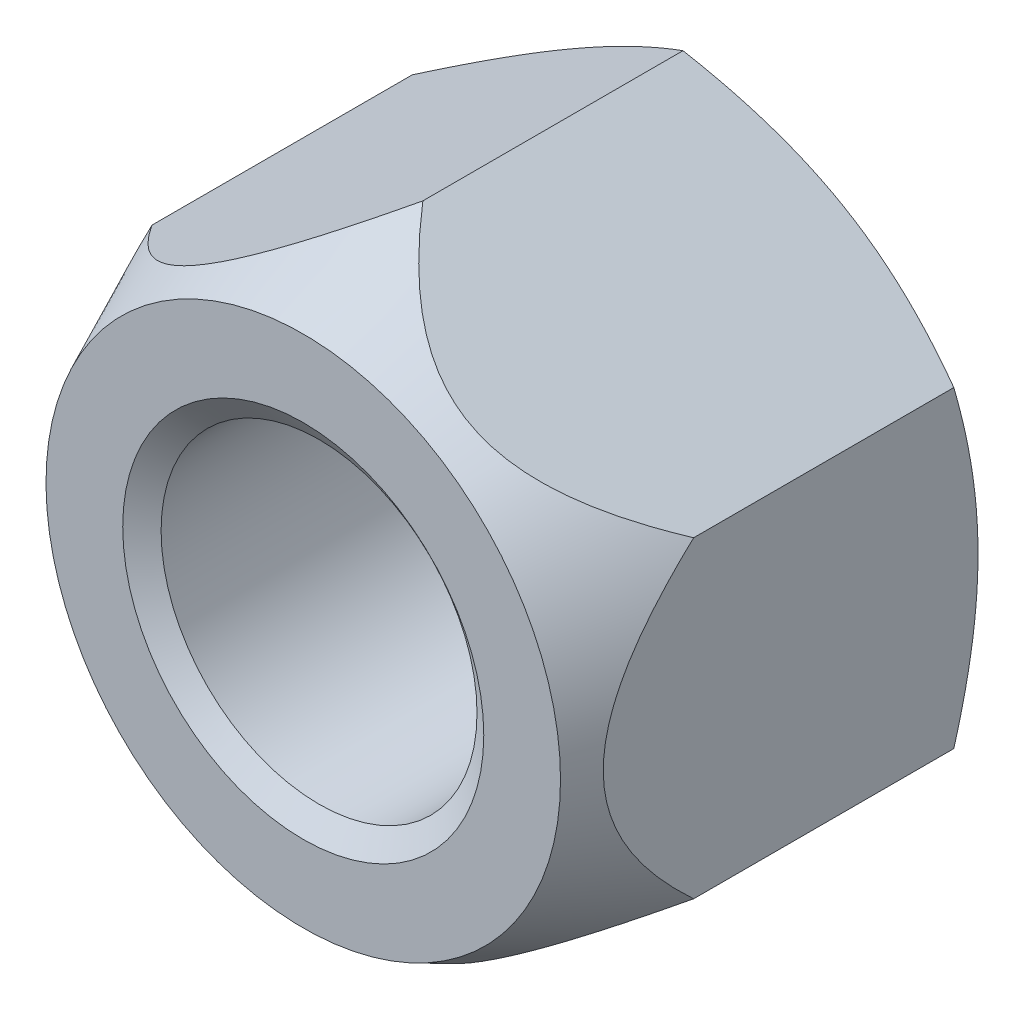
ISO-10303-21;
HEADER;
FILE_DESCRIPTION(('STEP AP214'),'2;1');
FILE_NAME('part.step','',(''),(''),'','','');
FILE_SCHEMA(('AUTOMOTIVE_DESIGN { 1 0 10303 214 1 1 1 1 }'));
ENDSEC;
DATA;
#1=APPLICATION_CONTEXT('core data for automotive mechanical design processes');
#2=APPLICATION_PROTOCOL_DEFINITION('international standard','automotive_design',2000,#1);
#3=PRODUCT_CONTEXT('',#1,'mechanical');
#4=PRODUCT('Part','Part','',(#3));
#5=PRODUCT_RELATED_PRODUCT_CATEGORY('part','',(#4));
#6=PRODUCT_DEFINITION_FORMATION('','',#4);
#7=PRODUCT_DEFINITION_CONTEXT('part definition',#1,'design');
#8=PRODUCT_DEFINITION('design','',#6,#7);
#9=PRODUCT_DEFINITION_SHAPE('','',#8);
#10=(LENGTH_UNIT() NAMED_UNIT(*) SI_UNIT(.MILLI.,.METRE.));
#11=(NAMED_UNIT(*) PLANE_ANGLE_UNIT() SI_UNIT($,.RADIAN.));
#12=(NAMED_UNIT(*) SI_UNIT($,.STERADIAN.) SOLID_ANGLE_UNIT());
#13=UNCERTAINTY_MEASURE_WITH_UNIT(LENGTH_MEASURE(1.E-05),#10,'distance_accuracy_value','');
#14=(GEOMETRIC_REPRESENTATION_CONTEXT(3) GLOBAL_UNCERTAINTY_ASSIGNED_CONTEXT((#13)) GLOBAL_UNIT_ASSIGNED_CONTEXT((#10,
#11,#12)) REPRESENTATION_CONTEXT('',''));
#15=CARTESIAN_POINT('',(0.,0.,0.));
#16=DIRECTION('',(0.,0.,1.));
#17=DIRECTION('',(1.,0.,0.));
#18=AXIS2_PLACEMENT_3D('',#15,#16,#17);
#19=CARTESIAN_POINT('',(0.,0.,-17.9));
#20=DIRECTION('',(0.,0.,1.));
#21=DIRECTION('',(1.,0.,0.));
#22=AXIS2_PLACEMENT_3D('',#19,#20,#21);
#23=CYLINDRICAL_SURFACE('',#22,7.);
#24=CARTESIAN_POINT('',(0.,0.,-0.700207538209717));
#25=DIRECTION('',(0.,0.,1.));
#26=DIRECTION('',(1.,0.,0.));
#27=AXIS2_PLACEMENT_3D('',#24,#25,#26);
#28=CIRCLE('',#27,7.);
#29=CARTESIAN_POINT('',(7.,0.,-0.700207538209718));
#30=VERTEX_POINT('',#29);
#31=EDGE_CURVE('E148',#30,#30,#28,.F.);
#32=CARTESIAN_POINT('',(0.,0.,-17.1743924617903));
#33=DIRECTION('',(0.,0.,-1.));
#34=DIRECTION('',(-1.,0.,0.));
#35=AXIS2_PLACEMENT_3D('',#32,#33,#34);
#36=CIRCLE('',#35,7.);
#37=CARTESIAN_POINT('',(7.,0.,-17.1743924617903));
#38=VERTEX_POINT('',#37);
#39=EDGE_CURVE('E37',#38,#38,#36,.F.);
#40=CARTESIAN_POINT('',(7.,0.,-0.700207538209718));
#41=CARTESIAN_POINT('',(7.,0.,-0.871813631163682));
#42=CARTESIAN_POINT('',(7.,0.,-1.04341972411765));
#43=CARTESIAN_POINT('',(7.,0.,-1.38663191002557));
#44=CARTESIAN_POINT('',(7.,0.,-1.55823800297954));
#45=CARTESIAN_POINT('',(7.,0.,-1.90145018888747));
#46=CARTESIAN_POINT('',(7.,0.,-2.07305628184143));
#47=CARTESIAN_POINT('',(7.,0.,-2.41626846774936));
#48=CARTESIAN_POINT('',(7.,0.,-2.58787456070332));
#49=CARTESIAN_POINT('',(7.,0.,-2.93108674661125));
#50=CARTESIAN_POINT('',(7.,0.,-3.10269283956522));
#51=CARTESIAN_POINT('',(7.,0.,-3.44590502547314));
#52=CARTESIAN_POINT('',(7.,0.,-3.61751111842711));
#53=CARTESIAN_POINT('',(7.,0.,-3.96072330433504));
#54=CARTESIAN_POINT('',(7.,0.,-4.132329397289));
#55=CARTESIAN_POINT('',(7.,0.,-4.47554158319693));
#56=CARTESIAN_POINT('',(7.,0.,-4.64714767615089));
#57=CARTESIAN_POINT('',(7.,0.,-4.99035986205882));
#58=CARTESIAN_POINT('',(7.,0.,-5.16196595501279));
#59=CARTESIAN_POINT('',(7.,0.,-5.50517814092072));
#60=CARTESIAN_POINT('',(7.,0.,-5.67678423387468));
#61=CARTESIAN_POINT('',(7.,0.,-6.01999641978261));
#62=CARTESIAN_POINT('',(7.,0.,-6.19160251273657));
#63=CARTESIAN_POINT('',(7.,0.,-6.5348146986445));
#64=CARTESIAN_POINT('',(7.,0.,-6.70642079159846));
#65=CARTESIAN_POINT('',(7.,0.,-7.04963297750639));
#66=CARTESIAN_POINT('',(7.,0.,-7.22123907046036));
#67=CARTESIAN_POINT('',(7.,0.,-7.56445125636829));
#68=CARTESIAN_POINT('',(7.,0.,-7.73605734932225));
#69=CARTESIAN_POINT('',(7.,0.,-8.07926953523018));
#70=CARTESIAN_POINT('',(7.,0.,-8.25087562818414));
#71=CARTESIAN_POINT('',(7.,0.,-8.59408781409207));
#72=CARTESIAN_POINT('',(7.,0.,-8.76569390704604));
#73=CARTESIAN_POINT('',(7.,0.,-9.10890609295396));
#74=CARTESIAN_POINT('',(7.,0.,-9.28051218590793));
#75=CARTESIAN_POINT('',(7.,0.,-9.62372437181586));
#76=CARTESIAN_POINT('',(7.,0.,-9.79533046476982));
#77=CARTESIAN_POINT('',(7.,0.,-10.1385426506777));
#78=CARTESIAN_POINT('',(7.,0.,-10.3101487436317));
#79=CARTESIAN_POINT('',(7.,0.,-10.6533609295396));
#80=CARTESIAN_POINT('',(7.,0.,-10.8249670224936));
#81=CARTESIAN_POINT('',(7.,0.,-11.1681792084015));
#82=CARTESIAN_POINT('',(7.,0.,-11.3397853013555));
#83=CARTESIAN_POINT('',(7.,0.,-11.6829974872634));
#84=CARTESIAN_POINT('',(7.,0.,-11.8546035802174));
#85=CARTESIAN_POINT('',(7.,0.,-12.1978157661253));
#86=CARTESIAN_POINT('',(7.,0.,-12.3694218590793));
#87=CARTESIAN_POINT('',(7.,0.,-12.7126340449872));
#88=CARTESIAN_POINT('',(7.,0.,-12.8842401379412));
#89=CARTESIAN_POINT('',(7.,0.,-13.2274523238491));
#90=CARTESIAN_POINT('',(7.,0.,-13.3990584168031));
#91=CARTESIAN_POINT('',(7.,0.,-13.742270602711));
#92=CARTESIAN_POINT('',(7.,0.,-13.913876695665));
#93=CARTESIAN_POINT('',(7.,0.,-14.2570888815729));
#94=CARTESIAN_POINT('',(7.,0.,-14.4286949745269));
#95=CARTESIAN_POINT('',(7.,0.,-14.7719071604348));
#96=CARTESIAN_POINT('',(7.,0.,-14.9435132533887));
#97=CARTESIAN_POINT('',(7.,0.,-15.2867254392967));
#98=CARTESIAN_POINT('',(7.,0.,-15.4583315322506));
#99=CARTESIAN_POINT('',(7.,0.,-15.8015437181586));
#100=CARTESIAN_POINT('',(7.,0.,-15.9731498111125));
#101=CARTESIAN_POINT('',(7.,0.,-16.3163619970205));
#102=CARTESIAN_POINT('',(7.,0.,-16.4879680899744));
#103=CARTESIAN_POINT('',(7.,0.,-16.8311802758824));
#104=CARTESIAN_POINT('',(7.,0.,-17.0027863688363));
#105=CARTESIAN_POINT('',(7.,0.,-17.1743924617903));
#106=B_SPLINE_CURVE_WITH_KNOTS('',3,(#40,#41,#42,#43,#44,#45,#46,#47,#48,#49,#50,#51,#52,#53,
#54,#55,#56,#57,#58,#59,#60,#61,#62,#63,#64,#65,#66,#67,#68,#69,#70,#71,#72,#73,#74,#75,#76,#77,
#78,#79,#80,#81,#82,#83,#84,#85,#86,#87,#88,#89,#90,#91,#92,#93,#94,#95,#96,#97,#98,#99,#100,
#101,#102,#103,#104,#105),.UNSPECIFIED.,.F.,.F.,(4,2,2,2,2,2,2,2,2,2,2,2,2,2,2,2,2,2,2,2,2,2,2,
2,2,2,2,2,2,2,2,2,4),(0.,0.514818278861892,1.02963655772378,1.54445483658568,2.05927311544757,
2.57409139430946,3.08890967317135,3.60372795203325,4.11854623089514,4.63336450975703,
5.14818278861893,5.66300106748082,6.17781934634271,6.6926376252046,7.2074559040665,
7.72227418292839,8.23709246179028,8.75191074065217,9.26672901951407,9.78154729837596,
10.2963655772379,10.8111838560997,11.3260021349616,11.8408204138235,12.3556386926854,
12.8704569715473,13.3852752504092,13.9000935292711,14.414911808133,14.9297300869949,
15.4445483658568,15.9593666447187,16.4741849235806),.UNSPECIFIED.);
#107=EDGE_CURVE('BSEAM32',#30,#38,#106,.T.);
#108=ORIENTED_EDGE('',*,*,#31,.F.);
#109=ORIENTED_EDGE('',*,*,#39,.F.);
#110=ORIENTED_EDGE('',*,*,#107,.T.);
#111=ORIENTED_EDGE('',*,*,#107,.F.);
#112=EDGE_LOOP('',(#108,#110,#109,#111));
#113=FACE_BOUND('',#112,.T.);
#114=ADVANCED_FACE('F32',(#113),#23,.F.);
#115=CARTESIAN_POINT('',(0.,13.856406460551,-17.9));
#116=DIRECTION('',(0.,0.,-1.));
#117=DIRECTION('',(-1.,0.,0.));
#118=AXIS2_PLACEMENT_3D('',#115,#116,#117);
#119=PLANE('',#118);
#120=CARTESIAN_POINT('',(0.,0.,-17.9));
#121=DIRECTION('',(0.,0.,-1.));
#122=DIRECTION('',(-1.,0.,0.));
#123=AXIS2_PLACEMENT_3D('',#120,#121,#122);
#124=CIRCLE('',#123,12.);
#125=CARTESIAN_POINT('',(-12.,0.,-17.9));
#126=VERTEX_POINT('',#125);
#127=CARTESIAN_POINT('',(-6.,-10.3923048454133,-17.9));
#128=VERTEX_POINT('',#127);
#129=EDGE_CURVE('E11',#126,#128,#124,.F.);
#130=ORIENTED_EDGE('',*,*,#129,.F.);
#131=CARTESIAN_POINT('',(-6.00000000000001,10.3923048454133,-17.9));
#132=VERTEX_POINT('',#131);
#133=EDGE_CURVE('E44',#132,#126,#124,.F.);
#134=ORIENTED_EDGE('',*,*,#133,.F.);
#135=CARTESIAN_POINT('',(6.00000000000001,10.3923048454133,-17.9));
#136=VERTEX_POINT('',#135);
#137=EDGE_CURVE('E147',#136,#132,#124,.F.);
#138=ORIENTED_EDGE('',*,*,#137,.F.);
#139=CARTESIAN_POINT('',(0.,0.,-17.9));
#140=DIRECTION('',(0.,0.,1.));
#141=DIRECTION('',(1.,0.,0.));
#142=AXIS2_PLACEMENT_3D('',#139,#140,#141);
#143=CIRCLE('',#142,12.);
#144=CARTESIAN_POINT('',(12.,0.,-17.9));
#145=VERTEX_POINT('',#144);
#146=EDGE_CURVE('E320',#145,#136,#143,.T.);
#147=ORIENTED_EDGE('',*,*,#146,.F.);
#148=CARTESIAN_POINT('',(6.,-10.3923048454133,-17.9));
#149=VERTEX_POINT('',#148);
#150=EDGE_CURVE('E315',#149,#145,#124,.F.);
#151=ORIENTED_EDGE('',*,*,#150,.F.);
#152=EDGE_CURVE('E42',#128,#149,#124,.F.);
#153=ORIENTED_EDGE('',*,*,#152,.F.);
#154=EDGE_LOOP('',(#130,#134,#138,#147,#151,#153));
#155=FACE_BOUND('',#154,.T.);
#156=CARTESIAN_POINT('',(0.,0.,-17.9));
#157=DIRECTION('',(0.,0.,-1.));
#158=DIRECTION('',(-1.,0.,0.));
#159=AXIS2_PLACEMENT_3D('',#156,#157,#158);
#160=CIRCLE('',#159,8.);
#161=CARTESIAN_POINT('',(-8.,0.,-17.9));
#162=VERTEX_POINT('',#161);
#163=EDGE_CURVE('E152',#162,#162,#160,.F.);
#164=ORIENTED_EDGE('',*,*,#163,.T.);
#165=EDGE_LOOP('',(#164));
#166=FACE_BOUND('',#165,.T.);
#167=ADVANCED_FACE('F264',(#155,#166),#119,.T.);
#168=CARTESIAN_POINT('',(0.,13.856406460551,0.));
#169=DIRECTION('',(0.,0.,-1.));
#170=DIRECTION('',(-1.,0.,0.));
#171=AXIS2_PLACEMENT_3D('',#168,#169,#170);
#172=PLANE('',#171);
#173=CARTESIAN_POINT('',(0.,0.,0.));
#174=DIRECTION('',(0.,0.,1.));
#175=DIRECTION('',(1.,0.,0.));
#176=AXIS2_PLACEMENT_3D('',#173,#174,#175);
#177=CIRCLE('',#176,11.4);
#178=CARTESIAN_POINT('',(11.4,0.,0.));
#179=VERTEX_POINT('',#178);
#180=EDGE_CURVE('E150',#179,#179,#177,.T.);
#181=ORIENTED_EDGE('',*,*,#180,.T.);
#182=EDGE_LOOP('',(#181));
#183=FACE_BOUND('',#182,.T.);
#184=CARTESIAN_POINT('',(0.,0.,0.));
#185=DIRECTION('',(0.,0.,1.));
#186=DIRECTION('',(1.,0.,0.));
#187=AXIS2_PLACEMENT_3D('',#184,#185,#186);
#188=CIRCLE('',#187,8.);
#189=CARTESIAN_POINT('',(8.,0.,0.));
#190=VERTEX_POINT('',#189);
#191=EDGE_CURVE('E151',#190,#190,#188,.T.);
#192=ORIENTED_EDGE('',*,*,#191,.F.);
#193=EDGE_LOOP('',(#192));
#194=FACE_BOUND('',#193,.T.);
#195=ADVANCED_FACE('F216',(#183,#194),#172,.F.);
#196=CARTESIAN_POINT('',(0.,13.856406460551,-17.9));
#197=DIRECTION('',(-0.5,0.866025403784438,0.));
#198=DIRECTION('',(-0.866025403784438,-0.5,0.));
#199=AXIS2_PLACEMENT_3D('',#196,#197,#198);
#200=PLANE('',#199);
#201=DIRECTION('',(0.,0.,1.));
#202=VECTOR('',#201,1.);
#203=CARTESIAN_POINT('',(-12.,6.92820323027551,-17.9));
#204=LINE('',#203,#202);
#205=CARTESIAN_POINT('',(-12.,6.92820323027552,-16.8282032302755));
#206=VERTEX_POINT('',#205);
#207=CARTESIAN_POINT('',(-12.,6.92820323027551,-5.29999999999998));
#208=VERTEX_POINT('',#207);
#209=EDGE_CURVE('E142',#206,#208,#204,.T.);
#210=ORIENTED_EDGE('',*,*,#209,.T.);
#211=CARTESIAN_POINT('',(-12.0001605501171,6.9281105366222,-5.3002));
#212=CARTESIAN_POINT('',(-11.8815696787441,6.99657900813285,-5.1524929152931));
#213=CARTESIAN_POINT('',(-11.7615721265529,7.06585962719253,-5.00626946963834));
#214=CARTESIAN_POINT('',(-11.5184122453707,7.20624805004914,-4.7172889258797));
#215=CARTESIAN_POINT('',(-11.3952489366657,7.27735641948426,-4.57453292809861));
#216=CARTESIAN_POINT('',(-11.1445923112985,7.42207308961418,-4.29207923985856));
#217=CARTESIAN_POINT('',(-11.0170744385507,7.49569556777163,-4.15241050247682));
#218=CARTESIAN_POINT('',(-10.7582006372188,7.64515642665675,-3.87791875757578));
#219=CARTESIAN_POINT('',(-10.6268450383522,7.72099461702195,-3.74309533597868));
#220=CARTESIAN_POINT('',(-10.355308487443,7.87776631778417,-3.47461123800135));
#221=CARTESIAN_POINT('',(-10.2149793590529,7.95878537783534,-3.34114875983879));
#222=CARTESIAN_POINT('',(-9.9293493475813,8.12369394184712,-3.08152647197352));
#223=CARTESIAN_POINT('',(-9.78404764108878,8.20758392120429,-2.95536788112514));
#224=CARTESIAN_POINT('',(-9.34080256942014,8.46349158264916,-2.59065308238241));
#225=CARTESIAN_POINT('',(-9.03456553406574,8.64029761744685,-2.36488956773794));
#226=CARTESIAN_POINT('',(-8.57922657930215,8.90318768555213,-2.07802811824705));
#227=CARTESIAN_POINT('',(-8.43978129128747,8.98369646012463,-1.99628980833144));
#228=CARTESIAN_POINT('',(-8.15637160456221,9.14732311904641,-1.8438304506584));
#229=CARTESIAN_POINT('',(-8.01240659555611,9.23044135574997,-1.77311089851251));
#230=CARTESIAN_POINT('',(-7.72129053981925,9.39851728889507,-1.64491263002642));
#231=CARTESIAN_POINT('',(-7.57417025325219,9.48345722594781,-1.58734141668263));
#232=CARTESIAN_POINT('',(-7.27630335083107,9.65543076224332,-1.48651370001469));
#233=CARTESIAN_POINT('',(-7.12555770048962,9.74246380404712,-1.44325342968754));
#234=CARTESIAN_POINT('',(-6.81908570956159,9.91940549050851,-1.37204913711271));
#235=CARTESIAN_POINT('',(-6.66331890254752,10.0093374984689,-1.3443347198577));
#236=CARTESIAN_POINT('',(-6.35018639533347,10.1901246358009,-1.30634054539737));
#237=CARTESIAN_POINT('',(-6.19282075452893,10.2809797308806,-1.29606014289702));
#238=CARTESIAN_POINT('',(-5.87782522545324,10.462842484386,-1.29338702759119));
#239=CARTESIAN_POINT('',(-5.72019522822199,10.5538502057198,-1.30101134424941));
#240=CARTESIAN_POINT('',(-5.40632825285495,10.7350613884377,-1.3338438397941));
#241=CARTESIAN_POINT('',(-5.25009126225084,10.8252648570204,-1.35905186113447));
#242=CARTESIAN_POINT('',(-4.95978180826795,10.9928750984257,-1.42178093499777));
#243=CARTESIAN_POINT('',(-4.82538911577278,11.0704667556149,-1.45735896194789));
#244=CARTESIAN_POINT('',(-4.55929199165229,11.2240980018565,-1.54012116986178));
#245=CARTESIAN_POINT('',(-4.42758850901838,11.3001370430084,-1.58730937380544));
#246=CARTESIAN_POINT('',(-4.03721048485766,11.5255219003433,-1.74456166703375));
#247=CARTESIAN_POINT('',(-3.78322224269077,11.6721620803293,-1.87032408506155));
#248=CARTESIAN_POINT('',(-3.29987361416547,11.9512235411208,-2.1480559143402));
#249=CARTESIAN_POINT('',(-3.06992738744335,12.083983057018,-2.29870824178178));
#250=CARTESIAN_POINT('',(-2.6221653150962,12.3424986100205,-2.62267432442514));
#251=CARTESIAN_POINT('',(-2.40436117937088,12.4682478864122,-2.79600943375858));
#252=CARTESIAN_POINT('',(-1.97913456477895,12.7137525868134,-3.16049066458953));
#253=CARTESIAN_POINT('',(-1.77175276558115,12.8334845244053,-3.35169932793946));
#254=CARTESIAN_POINT('',(-1.36686899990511,13.0672442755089,-3.74731983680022));
#255=CARTESIAN_POINT('',(-1.16936327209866,13.1812742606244,-3.95172658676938));
#256=CARTESIAN_POINT('',(-0.806857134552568,13.3905672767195,-4.3448037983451));
#257=CARTESIAN_POINT('',(-0.640868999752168,13.4864005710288,-4.53226971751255));
#258=CARTESIAN_POINT('',(-0.315746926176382,13.6741098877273,-4.91240631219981));
#259=CARTESIAN_POINT('',(-0.156573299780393,13.7660088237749,-5.10503164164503));
#260=CARTESIAN_POINT('',(0.000160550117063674,13.8564991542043,-5.30020000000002));
#261=B_SPLINE_CURVE_WITH_KNOTS('',3,(#211,#212,#213,#214,#215,#216,#217,#218,#219,#220,#221,
#222,#223,#224,#225,#226,#227,#228,#229,#230,#231,#232,#233,#234,#235,#236,#237,#238,#239,#240,
#241,#242,#243,#244,#245,#246,#247,#248,#249,#250,#251,#252,#253,#254,#255,#256,#257,#258,#259,
#260),.UNSPECIFIED.,.F.,.F.,(4,2,2,2,2,2,2,2,2,2,2,2,2,2,2,2,2,2,2,2,2,2,2,2,4),(0.,
0.604265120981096,1.20871955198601,1.81747069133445,2.4261696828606,3.05572936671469,
3.68539380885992,4.94033771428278,5.48175072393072,6.0232371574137,6.56078814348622,
7.09819751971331,7.64334820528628,8.1884787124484,8.73412791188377,9.27977222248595,
9.75691746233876,10.2342282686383,11.1886884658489,12.1032029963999,13.0185847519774,
13.9372988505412,14.8556603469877,15.6598072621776,16.4583532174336),.UNSPECIFIED.);
#262=CARTESIAN_POINT('',(0.,13.856406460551,-5.3));
#263=VERTEX_POINT('',#262);
#264=EDGE_CURVE('E51',#208,#263,#261,.T.);
#265=ORIENTED_EDGE('',*,*,#264,.T.);
#266=DIRECTION('',(0.,0.,1.));
#267=VECTOR('',#266,1.);
#268=CARTESIAN_POINT('',(0.,13.856406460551,-17.9));
#269=LINE('',#268,#267);
#270=CARTESIAN_POINT('',(0.,13.856406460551,-16.8282032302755));
#271=VERTEX_POINT('',#270);
#272=EDGE_CURVE('E124',#271,#263,#269,.T.);
#273=ORIENTED_EDGE('',*,*,#272,.F.);
#274=CARTESIAN_POINT('',(-12.0002,6.92808776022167,-16.8281365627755));
#275=CARTESIAN_POINT('',(-11.7364142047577,7.08038456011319,-16.9160503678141));
#276=CARTESIAN_POINT('',(-11.4716448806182,7.23324920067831,-16.9999740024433));
#277=CARTESIAN_POINT('',(-10.9399829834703,7.54020434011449,-17.1587337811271));
#278=CARTESIAN_POINT('',(-10.6730897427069,7.69429522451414,-17.2335669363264));
#279=CARTESIAN_POINT('',(-9.86810959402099,8.15905073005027,-17.4429824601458));
#280=CARTESIAN_POINT('',(-9.32684492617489,8.47155003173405,-17.5620967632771));
#281=CARTESIAN_POINT('',(-8.516867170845,8.93919090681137,-17.7017689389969));
#282=CARTESIAN_POINT('',(-8.25057389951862,9.09293539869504,-17.7415562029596));
#283=CARTESIAN_POINT('',(-7.71675440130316,9.40113622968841,-17.8082766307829));
#284=CARTESIAN_POINT('',(-7.44922815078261,9.55559258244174,-17.8352095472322));
#285=CARTESIAN_POINT('',(-6.91372963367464,9.86476279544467,-17.8755314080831));
#286=CARTESIAN_POINT('',(-6.64575827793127,10.0194761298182,-17.8889364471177));
#287=CARTESIAN_POINT('',(-6.10956726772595,10.3290461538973,-17.9019169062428));
#288=CARTESIAN_POINT('',(-5.84134762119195,10.4839028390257,-17.9014927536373));
#289=CARTESIAN_POINT('',(-5.33991062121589,10.7734076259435,-17.8877799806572));
#290=CARTESIAN_POINT('',(-5.10665750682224,10.908076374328,-17.8761640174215));
#291=CARTESIAN_POINT('',(-4.64068775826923,11.1771041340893,-17.8426919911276));
#292=CARTESIAN_POINT('',(-4.40797116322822,11.3114631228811,-17.8208352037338));
#293=CARTESIAN_POINT('',(-3.94320092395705,11.5797983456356,-17.7672625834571));
#294=CARTESIAN_POINT('',(-3.71114798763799,11.7137741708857,-17.7355386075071));
#295=CARTESIAN_POINT('',(-3.24813003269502,11.9810977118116,-17.6627882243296));
#296=CARTESIAN_POINT('',(-3.01716508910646,12.1144453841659,-17.6217611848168));
#297=CARTESIAN_POINT('',(-2.31605804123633,12.5192297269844,-17.4836883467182));
#298=CARTESIAN_POINT('',(-1.84794625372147,12.789494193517,-17.3728751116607));
#299=CARTESIAN_POINT('',(-0.918702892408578,13.3259930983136,-17.1213742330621));
#300=CARTESIAN_POINT('',(-0.457559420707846,13.5922344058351,-16.9807456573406));
#301=CARTESIAN_POINT('',(0.000199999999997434,13.8565219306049,-16.8281365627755));
#302=B_SPLINE_CURVE_WITH_KNOTS('',3,(#274,#275,#276,#277,#278,#279,#280,#281,#282,#283,#284,
#285,#286,#287,#288,#289,#290,#291,#292,#293,#294,#295,#296,#297,#298,#299,#300,#301),
.UNSPECIFIED.,.F.,.F.,(4,2,2,2,2,2,2,2,2,2,2,2,2,4),(0.,0.951004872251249,1.90232158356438,
3.80900466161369,4.73894551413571,5.6689042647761,6.59775529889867,7.52657763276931,
8.3351464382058,9.1437724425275,9.95306755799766,10.7624176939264,12.4167102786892,
14.0677556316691),.UNSPECIFIED.);
#303=EDGE_CURVE('E144',#132,#271,#302,.T.);
#304=ORIENTED_EDGE('',*,*,#303,.F.);
#305=EDGE_CURVE('E226',#206,#132,#302,.T.);
#306=ORIENTED_EDGE('',*,*,#305,.F.);
#307=EDGE_LOOP('',(#210,#265,#273,#304,#306));
#308=FACE_BOUND('',#307,.T.);
#309=ADVANCED_FACE('F34',(#308),#200,.T.);
#310=CARTESIAN_POINT('',(12.,6.92820323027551,-17.9));
#311=DIRECTION('',(0.5,0.866025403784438,0.));
#312=DIRECTION('',(-0.866025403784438,0.5,0.));
#313=AXIS2_PLACEMENT_3D('',#310,#311,#312);
#314=PLANE('',#313);
#315=ORIENTED_EDGE('',*,*,#272,.T.);
#316=CARTESIAN_POINT('',(-0.000160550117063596,13.8564991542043,-5.30020000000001));
#317=CARTESIAN_POINT('',(0.118430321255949,13.7880306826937,-5.15249291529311));
#318=CARTESIAN_POINT('',(0.238427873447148,13.718750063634,-5.00626946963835));
#319=CARTESIAN_POINT('',(0.481587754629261,13.5783616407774,-4.71728892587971));
#320=CARTESIAN_POINT('',(0.604751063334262,13.5072532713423,-4.57453292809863));
#321=CARTESIAN_POINT('',(0.855407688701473,13.3625366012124,-4.29207923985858));
#322=CARTESIAN_POINT('',(0.9829255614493,13.2889141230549,-4.15241050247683));
#323=CARTESIAN_POINT('',(1.24179936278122,13.1394532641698,-3.87791875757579));
#324=CARTESIAN_POINT('',(1.37315496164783,13.0636150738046,-3.74309533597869));
#325=CARTESIAN_POINT('',(1.64469151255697,12.9068433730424,-3.47461123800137));
#326=CARTESIAN_POINT('',(1.78502064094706,12.8258243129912,-3.3411487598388));
#327=CARTESIAN_POINT('',(2.0706506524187,12.6609157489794,-3.08152647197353));
#328=CARTESIAN_POINT('',(2.21595235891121,12.5770257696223,-2.95536788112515));
#329=CARTESIAN_POINT('',(2.65919743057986,12.3211181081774,-2.59065308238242));
#330=CARTESIAN_POINT('',(2.96543446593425,12.1443120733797,-2.36488956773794));
#331=CARTESIAN_POINT('',(3.42077342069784,11.8814220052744,-2.07802811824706));
#332=CARTESIAN_POINT('',(3.56021870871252,11.8009132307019,-1.99628980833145));
#333=CARTESIAN_POINT('',(3.84362839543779,11.6372865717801,-1.84383045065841));
#334=CARTESIAN_POINT('',(3.98759340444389,11.5541683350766,-1.77311089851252));
#335=CARTESIAN_POINT('',(4.27870946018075,11.3860924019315,-1.64491263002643));
#336=CARTESIAN_POINT('',(4.42582974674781,11.3011524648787,-1.58734141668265));
#337=CARTESIAN_POINT('',(4.72369664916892,11.1291789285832,-1.4865137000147));
#338=CARTESIAN_POINT('',(4.87444229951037,11.0421458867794,-1.44325342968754));
#339=CARTESIAN_POINT('',(5.18091429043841,10.865204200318,-1.37204913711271));
#340=CARTESIAN_POINT('',(5.33668109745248,10.7752721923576,-1.3443347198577));
#341=CARTESIAN_POINT('',(5.64981360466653,10.5944850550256,-1.30634054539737));
#342=CARTESIAN_POINT('',(5.80717924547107,10.5036299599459,-1.29606014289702));
#343=CARTESIAN_POINT('',(6.12217477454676,10.3217672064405,-1.29338702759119));
#344=CARTESIAN_POINT('',(6.27980477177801,10.2307594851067,-1.30101134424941));
#345=CARTESIAN_POINT('',(6.59367174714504,10.0495483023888,-1.3338438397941));
#346=CARTESIAN_POINT('',(6.74990873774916,9.95934483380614,-1.35905186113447));
#347=CARTESIAN_POINT('',(7.04021819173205,9.79173459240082,-1.42178093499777));
#348=CARTESIAN_POINT('',(7.17461088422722,9.71414293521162,-1.45735896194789));
#349=CARTESIAN_POINT('',(7.44070800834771,9.56051168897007,-1.54012116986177));
#350=CARTESIAN_POINT('',(7.57241149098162,9.48447264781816,-1.58730937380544));
#351=CARTESIAN_POINT('',(7.96278951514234,9.25908779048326,-1.74456166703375));
#352=CARTESIAN_POINT('',(8.21677775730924,9.1124476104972,-1.87032408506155));
#353=CARTESIAN_POINT('',(8.70012638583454,8.83338614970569,-2.14805591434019));
#354=CARTESIAN_POINT('',(8.93007261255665,8.70062663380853,-2.29870824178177));
#355=CARTESIAN_POINT('',(9.3778346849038,8.442111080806,-2.62267432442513));
#356=CARTESIAN_POINT('',(9.59563882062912,8.31636180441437,-2.79600943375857));
#357=CARTESIAN_POINT('',(10.020865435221,8.07085710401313,-3.16049066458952));
#358=CARTESIAN_POINT('',(10.2282472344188,7.95112516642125,-3.35169932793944));
#359=CARTESIAN_POINT('',(10.6331310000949,7.71736541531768,-3.7473198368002));
#360=CARTESIAN_POINT('',(10.8306367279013,7.60333543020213,-3.95172658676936));
#361=CARTESIAN_POINT('',(11.1931428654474,7.394042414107,-4.34480379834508));
#362=CARTESIAN_POINT('',(11.3591310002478,7.29820911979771,-4.53226971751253));
#363=CARTESIAN_POINT('',(11.6842530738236,7.11049980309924,-4.9124063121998));
#364=CARTESIAN_POINT('',(11.8434267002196,7.01860086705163,-5.10503164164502));
#365=CARTESIAN_POINT('',(12.0001605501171,6.9281105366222,-5.3002));
#366=B_SPLINE_CURVE_WITH_KNOTS('',3,(#316,#317,#318,#319,#320,#321,#322,#323,#324,#325,#326,
#327,#328,#329,#330,#331,#332,#333,#334,#335,#336,#337,#338,#339,#340,#341,#342,#343,#344,#345,
#346,#347,#348,#349,#350,#351,#352,#353,#354,#355,#356,#357,#358,#359,#360,#361,#362,#363,#364,
#365),.UNSPECIFIED.,.F.,.F.,(4,2,2,2,2,2,2,2,2,2,2,2,2,2,2,2,2,2,2,2,2,2,2,2,4),(0.,
0.604265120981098,1.20871955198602,1.81747069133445,2.4261696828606,3.05572936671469,
3.68539380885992,4.94033771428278,5.48175072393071,6.0232371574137,6.56078814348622,
7.09819751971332,7.64334820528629,8.18847871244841,8.73412791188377,9.27977222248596,
9.75691746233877,10.2342282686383,11.188688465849,12.1032029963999,13.0185847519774,
13.9372988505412,14.8556603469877,15.6598072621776,16.4583532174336),.UNSPECIFIED.);
#367=CARTESIAN_POINT('',(12.,6.92820323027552,-5.3));
#368=VERTEX_POINT('',#367);
#369=EDGE_CURVE('E108',#263,#368,#366,.T.);
#370=ORIENTED_EDGE('',*,*,#369,.T.);
#371=DIRECTION('',(0.,0.,1.));
#372=VECTOR('',#371,1.);
#373=CARTESIAN_POINT('',(12.,6.92820323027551,-17.9));
#374=LINE('',#373,#372);
#375=CARTESIAN_POINT('',(12.,6.92820323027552,-16.8282032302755));
#376=VERTEX_POINT('',#375);
#377=EDGE_CURVE('E121',#376,#368,#374,.T.);
#378=ORIENTED_EDGE('',*,*,#377,.F.);
#379=CARTESIAN_POINT('',(-0.000199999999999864,13.8565219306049,-16.8281365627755));
#380=CARTESIAN_POINT('',(0.263585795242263,13.7042251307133,-16.9160503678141));
#381=CARTESIAN_POINT('',(0.528355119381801,13.5513604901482,-16.9999740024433));
#382=CARTESIAN_POINT('',(1.06001701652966,13.244405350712,-17.1587337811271));
#383=CARTESIAN_POINT('',(1.32691025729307,13.0903144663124,-17.2335669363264));
#384=CARTESIAN_POINT('',(2.13189040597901,12.6255589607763,-17.4429824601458));
#385=CARTESIAN_POINT('',(2.67315507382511,12.3130596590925,-17.5620967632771));
#386=CARTESIAN_POINT('',(3.483132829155,11.8454187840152,-17.7017689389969));
#387=CARTESIAN_POINT('',(3.74942610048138,11.6916742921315,-17.7415562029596));
#388=CARTESIAN_POINT('',(4.28324559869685,11.3834734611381,-17.8082766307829));
#389=CARTESIAN_POINT('',(4.55077184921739,11.2290171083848,-17.8352095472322));
#390=CARTESIAN_POINT('',(5.08627036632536,10.9198468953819,-17.8755314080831));
#391=CARTESIAN_POINT('',(5.35424172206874,10.7651335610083,-17.8889364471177));
#392=CARTESIAN_POINT('',(5.89043273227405,10.4555635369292,-17.9019169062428));
#393=CARTESIAN_POINT('',(6.15865237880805,10.3007068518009,-17.9014927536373));
#394=CARTESIAN_POINT('',(6.66008937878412,10.011202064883,-17.8877799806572));
#395=CARTESIAN_POINT('',(6.89334249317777,9.87653331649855,-17.8761640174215));
#396=CARTESIAN_POINT('',(7.35931224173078,9.60750555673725,-17.8426919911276));
#397=CARTESIAN_POINT('',(7.59202883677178,9.47314656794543,-17.8208352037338));
#398=CARTESIAN_POINT('',(8.05679907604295,9.20481134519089,-17.7672625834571));
#399=CARTESIAN_POINT('',(8.28885201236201,9.07083551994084,-17.7355386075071));
#400=CARTESIAN_POINT('',(8.75186996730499,8.80351197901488,-17.6627882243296));
#401=CARTESIAN_POINT('',(8.98283491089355,8.67016430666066,-17.6217611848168));
#402=CARTESIAN_POINT('',(9.68394195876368,8.2653799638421,-17.4836883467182));
#403=CARTESIAN_POINT('',(10.1520537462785,7.99511549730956,-17.3728751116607));
#404=CARTESIAN_POINT('',(11.0812971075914,7.45861659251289,-17.1213742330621));
#405=CARTESIAN_POINT('',(11.5424405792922,7.19237528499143,-16.9807456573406));
#406=CARTESIAN_POINT('',(12.0002,6.92808776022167,-16.8281365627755));
#407=B_SPLINE_CURVE_WITH_KNOTS('',3,(#379,#380,#381,#382,#383,#384,#385,#386,#387,#388,#389,
#390,#391,#392,#393,#394,#395,#396,#397,#398,#399,#400,#401,#402,#403,#404,#405,#406),
.UNSPECIFIED.,.F.,.F.,(4,2,2,2,2,2,2,2,2,2,2,2,2,4),(0.,0.951004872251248,1.90232158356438,
3.8090046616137,4.73894551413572,5.66890426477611,6.59775529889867,7.52657763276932,
8.3351464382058,9.14377244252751,9.95306755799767,10.7624176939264,12.4167102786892,
14.0677556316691),.UNSPECIFIED.);
#408=EDGE_CURVE('E220',#136,#376,#407,.T.);
#409=ORIENTED_EDGE('',*,*,#408,.F.);
#410=EDGE_CURVE('E225',#271,#136,#407,.T.);
#411=ORIENTED_EDGE('',*,*,#410,.F.);
#412=EDGE_LOOP('',(#315,#370,#378,#409,#411));
#413=FACE_BOUND('',#412,.T.);
#414=ADVANCED_FACE('F119',(#413),#314,.T.);
#415=CARTESIAN_POINT('',(12.,6.92820323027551,-17.9));
#416=DIRECTION('',(-1.,0.,0.));
#417=DIRECTION('',(0.,0.,1.));
#418=AXIS2_PLACEMENT_3D('',#415,#416,#417);
#419=PLANE('',#418);
#420=CARTESIAN_POINT('',(12.,-25.4633844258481,-36.1387140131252));
#421=CARTESIAN_POINT('',(12.,-25.1847308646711,-35.5948575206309));
#422=CARTESIAN_POINT('',(12.,-24.9054236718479,-35.0513360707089));
#423=CARTESIAN_POINT('',(12.,-24.3453587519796,-33.9650393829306));
#424=CARTESIAN_POINT('',(12.,-24.0646010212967,-33.4222641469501));
#425=CARTESIAN_POINT('',(12.,-23.2198893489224,-31.7950799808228));
#426=CARTESIAN_POINT('',(12.,-22.6535462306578,-30.7119089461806));
#427=CARTESIAN_POINT('',(12.,-21.5106628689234,-28.5452240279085));
#428=CARTESIAN_POINT('',(12.,-20.9340901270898,-27.4617272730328));
#429=CARTESIAN_POINT('',(12.,-19.7710769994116,-25.300112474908));
#430=CARTESIAN_POINT('',(12.,-19.184637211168,-24.2219941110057));
#431=CARTESIAN_POINT('',(12.,-18.2664366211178,-22.5574934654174));
#432=CARTESIAN_POINT('',(12.,-17.9391166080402,-21.9686611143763));
#433=CARTESIAN_POINT('',(12.,-17.2800232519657,-20.7934955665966));
#434=CARTESIAN_POINT('',(12.,-16.9482499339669,-20.2071623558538));
#435=CARTESIAN_POINT('',(12.,-16.2794327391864,-19.0373432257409));
#436=CARTESIAN_POINT('',(12.,-15.942387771,-18.4538579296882));
#437=CARTESIAN_POINT('',(12.,-15.2621598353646,-17.2904773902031));
#438=CARTESIAN_POINT('',(12.,-14.9189769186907,-16.7105821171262));
#439=CARTESIAN_POINT('',(12.,-14.2260200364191,-15.556413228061));
#440=CARTESIAN_POINT('',(12.,-13.8762616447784,-14.9821302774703));
#441=CARTESIAN_POINT('',(12.,-13.1679106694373,-13.8389937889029));
#442=CARTESIAN_POINT('',(12.,-12.809317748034,-13.2701404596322));
#443=CARTESIAN_POINT('',(12.,-12.0814414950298,-12.1395961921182));
#444=CARTESIAN_POINT('',(12.,-11.712162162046,-11.5779026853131));
#445=CARTESIAN_POINT('',(12.,-10.96014008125,-10.4636272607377));
#446=CARTESIAN_POINT('',(12.,-10.5773987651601,-9.91104438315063));
#447=CARTESIAN_POINT('',(12.,-9.98456433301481,-9.08331611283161));
#448=CARTESIAN_POINT('',(12.,-9.7807989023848,-8.80363616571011));
#449=CARTESIAN_POINT('',(12.,-9.36801321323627,-8.24815963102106));
#450=CARTESIAN_POINT('',(12.,-9.15899281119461,-7.9723631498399));
#451=CARTESIAN_POINT('',(12.,-8.73466865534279,-7.42512285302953));
#452=CARTESIAN_POINT('',(12.,-8.51935788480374,-7.15368446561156));
#453=CARTESIAN_POINT('',(12.,-8.08172384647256,-6.6165189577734));
#454=CARTESIAN_POINT('',(12.,-7.85940083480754,-6.35079162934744));
#455=CARTESIAN_POINT('',(12.,-7.40927963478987,-5.82954503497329));
#456=CARTESIAN_POINT('',(12.,-7.18157946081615,-5.57394143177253));
#457=CARTESIAN_POINT('',(12.,-6.7167457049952,-5.07133222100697));
#458=CARTESIAN_POINT('',(12.,-6.47961050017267,-4.82432810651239));
#459=CARTESIAN_POINT('',(12.,-5.99471102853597,-4.34183007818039));
#460=CARTESIAN_POINT('',(12.,-5.746966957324,-4.10631597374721));
#461=CARTESIAN_POINT('',(12.,-5.23856047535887,-3.64975918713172));
#462=CARTESIAN_POINT('',(12.,-4.97790467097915,-3.42870923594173));
#463=CARTESIAN_POINT('',(12.,-4.53095378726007,-3.07640604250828));
#464=CARTESIAN_POINT('',(12.,-4.34887793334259,-2.93980738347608));
#465=CARTESIAN_POINT('',(12.,-3.97727386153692,-2.6770126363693));
#466=CARTESIAN_POINT('',(12.,-3.78774459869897,-2.55081801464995));
#467=CARTESIAN_POINT('',(12.,-3.40102826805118,-2.31141179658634));
#468=CARTESIAN_POINT('',(12.,-3.20385412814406,-2.19817946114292));
#469=CARTESIAN_POINT('',(12.,-2.8012908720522,-1.98735550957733));
#470=CARTESIAN_POINT('',(12.,-2.59590446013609,-1.88975879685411));
#471=CARTESIAN_POINT('',(12.,-2.22869115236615,-1.7352143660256));
#472=CARTESIAN_POINT('',(12.,-2.06858795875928,-1.67417446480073));
#473=CARTESIAN_POINT('',(12.,-1.74423997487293,-1.56437630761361));
#474=CARTESIAN_POINT('',(12.,-1.57999649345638,-1.51561422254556));
#475=CARTESIAN_POINT('',(12.,-1.24811948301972,-1.43181912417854));
#476=CARTESIAN_POINT('',(12.,-1.08048804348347,-1.39677790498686));
#477=CARTESIAN_POINT('',(12.,-0.742771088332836,-1.34158289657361));
#478=CARTESIAN_POINT('',(12.,-0.572685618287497,-1.32142883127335));
#479=CARTESIAN_POINT('',(12.,-0.230372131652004,-1.29669971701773));
#480=CARTESIAN_POINT('',(12.,-0.0581374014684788,-1.29221654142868));
#481=CARTESIAN_POINT('',(12.,0.285996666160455,-1.29926527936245));
#482=CARTESIAN_POINT('',(12.,0.457896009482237,-1.31079690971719));
#483=CARTESIAN_POINT('',(12.,0.799930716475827,-1.34941980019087));
#484=CARTESIAN_POINT('',(12.,0.970065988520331,-1.37651186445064));
#485=CARTESIAN_POINT('',(12.,1.30735757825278,-1.44525650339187));
#486=CARTESIAN_POINT('',(12.,1.47451345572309,-1.48691121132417));
#487=CARTESIAN_POINT('',(12.,1.8497587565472,-1.59652764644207));
#488=CARTESIAN_POINT('',(12.,2.0566589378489,-1.66855987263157));
#489=CARTESIAN_POINT('',(12.,2.46319227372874,-1.83088308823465));
#490=CARTESIAN_POINT('',(12.,2.66282122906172,-1.921184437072));
#491=CARTESIAN_POINT('',(12.,3.05494954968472,-2.11724454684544));
#492=CARTESIAN_POINT('',(12.,3.24742806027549,-2.22304465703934));
#493=CARTESIAN_POINT('',(12.,3.62483809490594,-2.44720814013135));
#494=CARTESIAN_POINT('',(12.,3.80977017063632,-2.56557059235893));
#495=CARTESIAN_POINT('',(12.,4.21664562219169,-2.84262521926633));
#496=CARTESIAN_POINT('',(12.,4.43666680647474,-3.0041296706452));
#497=CARTESIAN_POINT('',(12.,4.86696087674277,-3.33969747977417));
#498=CARTESIAN_POINT('',(12.,5.07722979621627,-3.5137658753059));
#499=CARTESIAN_POINT('',(12.,5.48940084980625,-3.87210617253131));
#500=CARTESIAN_POINT('',(12.,5.6912897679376,-4.05639319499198));
#501=CARTESIAN_POINT('',(12.,6.08745195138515,-4.43298848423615));
#502=CARTESIAN_POINT('',(12.,6.28172426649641,-4.62529774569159));
#503=CARTESIAN_POINT('',(12.,6.66604697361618,-5.01895733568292));
#504=CARTESIAN_POINT('',(12.,6.8560102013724,-5.220392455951));
#505=CARTESIAN_POINT('',(12.,7.22992651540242,-5.62875927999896));
#506=CARTESIAN_POINT('',(12.,7.41387942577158,-5.83569114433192));
#507=CARTESIAN_POINT('',(12.,7.7763044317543,-6.25390094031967));
#508=CARTESIAN_POINT('',(12.,7.95478218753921,-6.4651739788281));
#509=CARTESIAN_POINT('',(12.,8.30707270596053,-6.89155014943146));
#510=CARTESIAN_POINT('',(12.,8.48088566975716,-7.10665311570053));
#511=CARTESIAN_POINT('',(12.,8.85841995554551,-7.58306939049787));
#512=CARTESIAN_POINT('',(12.,9.06124326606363,-7.84509373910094));
#513=CARTESIAN_POINT('',(12.,9.46173535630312,-8.37305831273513));
#514=CARTESIAN_POINT('',(12.,9.65940391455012,-8.63899870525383));
#515=CARTESIAN_POINT('',(12.,10.2457243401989,-9.44183693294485));
#516=CARTESIAN_POINT('',(12.,10.62762576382,-9.98366857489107));
#517=CARTESIAN_POINT('',(12.,11.3776437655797,-11.0773294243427));
#518=CARTESIAN_POINT('',(12.,11.7457495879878,-11.6291659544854));
#519=CARTESIAN_POINT('',(12.,12.4706739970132,-12.7401188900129));
#520=CARTESIAN_POINT('',(12.,12.8274935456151,-13.2992346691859));
#521=CARTESIAN_POINT('',(12.,13.5332567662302,-14.4252166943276));
#522=CARTESIAN_POINT('',(12.,13.8821672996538,-14.9921036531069));
#523=CARTESIAN_POINT('',(12.,14.5723906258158,-16.1304902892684));
#524=CARTESIAN_POINT('',(12.,14.9137032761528,-16.7019900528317));
#525=CARTESIAN_POINT('',(12.,15.5898267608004,-17.8484882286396));
#526=CARTESIAN_POINT('',(12.,15.9246403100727,-18.4234850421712));
#527=CARTESIAN_POINT('',(12.,16.5888861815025,-19.5765688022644));
#528=CARTESIAN_POINT('',(12.,16.9183185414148,-20.1546557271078));
#529=CARTESIAN_POINT('',(12.,17.8189461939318,-21.7496886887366));
#530=CARTESIAN_POINT('',(12.,18.3853969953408,-22.7693136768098));
#531=CARTESIAN_POINT('',(12.,19.5074797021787,-24.8146425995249));
#532=CARTESIAN_POINT('',(12.,20.0631102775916,-25.8403472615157));
#533=CARTESIAN_POINT('',(12.,21.1618904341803,-27.889239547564));
#534=CARTESIAN_POINT('',(12.,21.7050999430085,-28.9123950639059));
#535=CARTESIAN_POINT('',(12.,22.5146903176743,-30.4497677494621));
#536=CARTESIAN_POINT('',(12.,22.7836616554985,-30.9626237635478));
#537=CARTESIAN_POINT('',(12.,23.3200339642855,-31.9891542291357));
#538=CARTESIAN_POINT('',(12.,23.5874349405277,-32.5028286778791));
#539=CARTESIAN_POINT('',(12.,23.8541295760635,-33.0168697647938));
#540=B_SPLINE_CURVE_WITH_KNOTS('',3,(#420,#421,#422,#423,#424,#425,#426,#427,#428,#429,#430,
#431,#432,#433,#434,#435,#436,#437,#438,#439,#440,#441,#442,#443,#444,#445,#446,#447,#448,#449,
#450,#451,#452,#453,#454,#455,#456,#457,#458,#459,#460,#461,#462,#463,#464,#465,#466,#467,#468,
#469,#470,#471,#472,#473,#474,#475,#476,#477,#478,#479,#480,#481,#482,#483,#484,#485,#486,#487,
#488,#489,#490,#491,#492,#493,#494,#495,#496,#497,#498,#499,#500,#501,#502,#503,#504,#505,#506,
#507,#508,#509,#510,#511,#512,#513,#514,#515,#516,#517,#518,#519,#520,#521,#522,#523,#524,#525,
#526,#527,#528,#529,#530,#531,#532,#533,#534,#535,#536,#537,#538,#539),.UNSPECIFIED.,.F.,.F.,(4,
2,2,2,2,2,2,2,2,2,2,2,2,2,2,2,2,2,2,2,2,2,2,2,2,2,2,2,2,2,2,2,2,2,2,2,2,2,2,2,2,2,2,2,2,2,2,2,2,
2,2,2,2,2,2,2,2,2,2,4),(0.,1.83326097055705,3.66652654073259,7.33338238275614,11.0154117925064,
14.6972189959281,16.7182818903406,18.7393334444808,20.7608091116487,22.7822680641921,
24.7994268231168,26.8166628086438,28.8331535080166,30.8494303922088,31.8874909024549,
32.9255797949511,33.9648745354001,35.0041313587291,36.0308884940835,37.0578230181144,
38.0828826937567,39.1074232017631,39.7899933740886,40.4726595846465,41.1542178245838,
41.8355534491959,42.3491599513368,42.8626060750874,43.375744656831,43.8888737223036,
44.4050060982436,44.9211293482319,45.4372792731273,45.9535048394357,46.6096913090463,
47.2662509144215,47.9245951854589,48.5828912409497,49.4011019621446,50.2196426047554,
51.0394285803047,51.8593165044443,52.6898140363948,53.5203358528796,54.349967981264,
55.1795642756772,56.1735421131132,57.1675625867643,59.1559205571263,61.145797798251,
63.1355049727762,65.1324057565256,67.1293439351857,69.1254291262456,71.1215003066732,
74.6206198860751,78.1201668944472,81.5953750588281,83.3326990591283,85.0700172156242),.UNSPECIFIED.);
#541=CARTESIAN_POINT('',(12.,-6.92820323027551,-5.3));
#542=VERTEX_POINT('',#541);
#543=EDGE_CURVE('E105',#542,#368,#540,.T.);
#544=ORIENTED_EDGE('',*,*,#543,.F.);
#545=DIRECTION('',(0.,0.,1.));
#546=VECTOR('',#545,1.);
#547=CARTESIAN_POINT('',(12.,-6.92820323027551,-17.9));
#548=LINE('',#547,#546);
#549=CARTESIAN_POINT('',(12.,-6.92820323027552,-16.8282032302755));
#550=VERTEX_POINT('',#549);
#551=EDGE_CURVE('E130',#550,#542,#548,.T.);
#552=ORIENTED_EDGE('',*,*,#551,.F.);
#553=CARTESIAN_POINT('',(12.,-18.3746159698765,-12.1576795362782));
#554=CARTESIAN_POINT('',(12.,-18.1111918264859,-12.2850148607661));
#555=CARTESIAN_POINT('',(12.,-17.8474492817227,-12.4116911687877));
#556=CARTESIAN_POINT('',(12.,-17.3192601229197,-12.6635744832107));
#557=CARTESIAN_POINT('',(12.,-17.0548135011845,-12.7887814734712));
#558=CARTESIAN_POINT('',(12.,-16.2602391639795,-13.1620078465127));
#559=CARTESIAN_POINT('',(12.,-15.7289626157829,-13.4075911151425));
#560=CARTESIAN_POINT('',(12.,-14.659698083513,-13.8920811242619));
#561=CARTESIAN_POINT('',(12.,-14.1216890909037,-14.1309416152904));
#562=CARTESIAN_POINT('',(12.,-13.0412497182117,-14.5984070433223));
#563=CARTESIAN_POINT('',(12.,-12.4988195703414,-14.8270125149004));
#564=CARTESIAN_POINT('',(12.,-11.4019415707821,-15.2739483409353));
#565=CARTESIAN_POINT('',(12.,-10.8474279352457,-15.492118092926));
#566=CARTESIAN_POINT('',(12.,-9.73185625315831,-15.9113713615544));
#567=CARTESIAN_POINT('',(12.,-9.17079748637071,-16.1124529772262));
#568=CARTESIAN_POINT('',(12.,-8.04241377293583,-16.4921242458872));
#569=CARTESIAN_POINT('',(12.,-7.47510504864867,-16.6707617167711));
#570=CARTESIAN_POINT('',(12.,-6.33236790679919,-16.9997519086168));
#571=CARTESIAN_POINT('',(12.,-5.75694211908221,-17.1501135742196));
#572=CARTESIAN_POINT('',(12.,-4.88760620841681,-17.3489449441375));
#573=CARTESIAN_POINT('',(12.,-4.5967330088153,-17.4107803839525));
#574=CARTESIAN_POINT('',(12.,-4.01305048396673,-17.524571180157));
#575=CARTESIAN_POINT('',(12.,-3.72024120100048,-17.5765267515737));
#576=CARTESIAN_POINT('',(12.,-3.13287727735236,-17.6696376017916));
#577=CARTESIAN_POINT('',(12.,-2.83832249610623,-17.7107919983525));
#578=CARTESIAN_POINT('',(12.,-2.24782315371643,-17.7814710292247));
#579=CARTESIAN_POINT('',(12.,-1.95187864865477,-17.8109961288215));
#580=CARTESIAN_POINT('',(12.,-1.3608923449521,-17.8576246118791));
#581=CARTESIAN_POINT('',(12.,-1.06585670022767,-17.8748054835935));
#582=CARTESIAN_POINT('',(12.,-0.475323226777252,-17.8966542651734));
#583=CARTESIAN_POINT('',(12.,-0.179825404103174,-17.9013223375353));
#584=CARTESIAN_POINT('',(12.,0.411018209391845,-17.8980347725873));
#585=CARTESIAN_POINT('',(12.,0.706364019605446,-17.8900826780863));
#586=CARTESIAN_POINT('',(12.,1.29646300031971,-17.8617523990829));
#587=CARTESIAN_POINT('',(12.,1.59121614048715,-17.8413735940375));
#588=CARTESIAN_POINT('',(12.,2.30560702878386,-17.7773472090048));
#589=CARTESIAN_POINT('',(12.,2.72469590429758,-17.7274734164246));
#590=CARTESIAN_POINT('',(12.,3.55966217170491,-17.6053725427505));
#591=CARTESIAN_POINT('',(12.,3.97553865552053,-17.5331393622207));
#592=CARTESIAN_POINT('',(12.,4.80373712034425,-17.3688815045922));
#593=CARTESIAN_POINT('',(12.,5.21605535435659,-17.2768381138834));
#594=CARTESIAN_POINT('',(12.,6.03644960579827,-17.0757685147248));
#595=CARTESIAN_POINT('',(12.,6.44452601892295,-16.966743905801));
#596=CARTESIAN_POINT('',(12.,7.26648771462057,-16.7314690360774));
#597=CARTESIAN_POINT('',(12.,7.68027019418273,-16.6048620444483));
#598=CARTESIAN_POINT('',(12.,8.50346065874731,-16.3391423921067));
#599=CARTESIAN_POINT('',(12.,8.91287144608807,-16.2000383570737));
#600=CARTESIAN_POINT('',(12.,9.72567950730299,-15.9121802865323));
#601=CARTESIAN_POINT('',(12.,10.1290976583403,-15.7634849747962));
#602=CARTESIAN_POINT('',(12.,10.7318330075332,-15.5339493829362));
#603=CARTESIAN_POINT('',(12.,10.9323890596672,-15.4563380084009));
#604=CARTESIAN_POINT('',(12.,11.3327210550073,-15.2991414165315));
#605=CARTESIAN_POINT('',(12.,11.5324970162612,-15.2195562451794));
#606=CARTESIAN_POINT('',(12.,11.7319109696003,-15.1390729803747));
#607=B_SPLINE_CURVE_WITH_KNOTS('',3,(#553,#554,#555,#556,#557,#558,#559,#560,#561,#562,#563,
#564,#565,#566,#567,#568,#569,#570,#571,#572,#573,#574,#575,#576,#577,#578,#579,#580,#581,#582,
#583,#584,#585,#586,#587,#588,#589,#590,#591,#592,#593,#594,#595,#596,#597,#598,#599,#600,#601,
#602,#603,#604,#605,#606),.UNSPECIFIED.,.F.,.F.,(4,2,2,2,2,2,2,2,2,2,2,2,2,2,2,2,2,2,2,2,2,2,2,
2,2,2,4),(0.,0.877756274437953,1.75552218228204,3.51133949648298,5.27720464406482,
7.04297763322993,8.83042883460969,10.6180786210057,12.4018527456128,14.1850616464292,
15.0770405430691,15.9690000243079,16.861032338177,17.7530289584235,18.63937614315,
19.5257118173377,20.4117987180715,21.2979298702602,22.5633628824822,23.8291413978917,
25.0961209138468,26.3629811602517,27.6608948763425,28.9579195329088,30.2476436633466,
30.8927835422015,31.5379084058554),.UNSPECIFIED.);
#608=EDGE_CURVE('E232',#550,#145,#607,.T.);
#609=ORIENTED_EDGE('',*,*,#608,.T.);
#610=EDGE_CURVE('E129',#145,#376,#607,.T.);
#611=ORIENTED_EDGE('',*,*,#610,.T.);
#612=ORIENTED_EDGE('',*,*,#377,.T.);
#613=EDGE_LOOP('',(#544,#552,#609,#611,#612));
#614=FACE_BOUND('',#613,.T.);
#615=ADVANCED_FACE('F127',(#614),#419,.F.);
#616=CARTESIAN_POINT('',(0.,-13.856406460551,-17.9));
#617=DIRECTION('',(0.5,-0.866025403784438,0.));
#618=DIRECTION('',(0.866025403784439,0.5,0.));
#619=AXIS2_PLACEMENT_3D('',#616,#617,#618);
#620=PLANE('',#619);
#621=ORIENTED_EDGE('',*,*,#551,.T.);
#622=CARTESIAN_POINT('',(12.0001605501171,-6.92811053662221,-5.3002));
#623=CARTESIAN_POINT('',(11.881569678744,-6.99657900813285,-5.1524929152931));
#624=CARTESIAN_POINT('',(11.7615721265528,-7.06585962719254,-5.00626946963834));
#625=CARTESIAN_POINT('',(11.5184122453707,-7.20624805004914,-4.7172889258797));
#626=CARTESIAN_POINT('',(11.3952489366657,-7.27735641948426,-4.57453292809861));
#627=CARTESIAN_POINT('',(11.1445923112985,-7.42207308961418,-4.29207923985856));
#628=CARTESIAN_POINT('',(11.0170744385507,-7.49569556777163,-4.15241050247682));
#629=CARTESIAN_POINT('',(10.7582006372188,-7.64515642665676,-3.87791875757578));
#630=CARTESIAN_POINT('',(10.6268450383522,-7.72099461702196,-3.74309533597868));
#631=CARTESIAN_POINT('',(10.355308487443,-7.87776631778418,-3.47461123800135));
#632=CARTESIAN_POINT('',(10.2149793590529,-7.95878537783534,-3.34114875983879));
#633=CARTESIAN_POINT('',(9.9293493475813,-8.12369394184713,-3.08152647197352));
#634=CARTESIAN_POINT('',(9.78404764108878,-8.20758392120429,-2.95536788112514));
#635=CARTESIAN_POINT('',(9.34080256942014,-8.46349158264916,-2.59065308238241));
#636=CARTESIAN_POINT('',(9.03456553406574,-8.64029761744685,-2.36488956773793));
#637=CARTESIAN_POINT('',(8.57922657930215,-8.90318768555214,-2.07802811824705));
#638=CARTESIAN_POINT('',(8.43978129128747,-8.98369646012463,-1.99628980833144));
#639=CARTESIAN_POINT('',(8.1563716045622,-9.14732311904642,-1.84383045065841));
#640=CARTESIAN_POINT('',(8.01240659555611,-9.23044135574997,-1.77311089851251));
#641=CARTESIAN_POINT('',(7.72129053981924,-9.39851728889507,-1.64491263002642));
#642=CARTESIAN_POINT('',(7.57417025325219,-9.48345722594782,-1.58734141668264));
#643=CARTESIAN_POINT('',(7.27630335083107,-9.65543076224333,-1.4865137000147));
#644=CARTESIAN_POINT('',(7.12555770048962,-9.74246380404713,-1.44325342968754));
#645=CARTESIAN_POINT('',(6.81908570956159,-9.91940549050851,-1.37204913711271));
#646=CARTESIAN_POINT('',(6.66331890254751,-10.0093374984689,-1.3443347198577));
#647=CARTESIAN_POINT('',(6.35018639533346,-10.1901246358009,-1.30634054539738));
#648=CARTESIAN_POINT('',(6.19282075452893,-10.2809797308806,-1.29606014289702));
#649=CARTESIAN_POINT('',(5.87782522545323,-10.462842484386,-1.2933870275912));
#650=CARTESIAN_POINT('',(5.72019522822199,-10.5538502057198,-1.30101134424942));
#651=CARTESIAN_POINT('',(5.40632825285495,-10.7350613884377,-1.33384383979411));
#652=CARTESIAN_POINT('',(5.25009126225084,-10.8252648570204,-1.35905186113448));
#653=CARTESIAN_POINT('',(4.95978180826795,-10.9928750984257,-1.42178093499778));
#654=CARTESIAN_POINT('',(4.82538911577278,-11.0704667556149,-1.45735896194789));
#655=CARTESIAN_POINT('',(4.55929199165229,-11.2240980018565,-1.54012116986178));
#656=CARTESIAN_POINT('',(4.42758850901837,-11.3001370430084,-1.58730937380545));
#657=CARTESIAN_POINT('',(4.03721048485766,-11.5255219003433,-1.74456166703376));
#658=CARTESIAN_POINT('',(3.78322224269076,-11.6721620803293,-1.87032408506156));
#659=CARTESIAN_POINT('',(3.29987361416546,-11.9512235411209,-2.1480559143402));
#660=CARTESIAN_POINT('',(3.06992738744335,-12.083983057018,-2.29870824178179));
#661=CARTESIAN_POINT('',(2.6221653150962,-12.3424986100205,-2.62267432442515));
#662=CARTESIAN_POINT('',(2.40436117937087,-12.4682478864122,-2.79600943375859));
#663=CARTESIAN_POINT('',(1.97913456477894,-12.7137525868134,-3.16049066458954));
#664=CARTESIAN_POINT('',(1.77175276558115,-12.8334845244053,-3.35169932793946));
#665=CARTESIAN_POINT('',(1.36686899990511,-13.0672442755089,-3.74731983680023));
#666=CARTESIAN_POINT('',(1.16936327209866,-13.1812742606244,-3.95172658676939));
#667=CARTESIAN_POINT('',(0.806857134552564,-13.3905672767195,-4.34480379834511));
#668=CARTESIAN_POINT('',(0.640868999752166,-13.4864005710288,-4.53226971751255));
#669=CARTESIAN_POINT('',(0.315746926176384,-13.6741098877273,-4.91240631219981));
#670=CARTESIAN_POINT('',(0.156573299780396,-13.7660088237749,-5.10503164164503));
#671=CARTESIAN_POINT('',(-0.000160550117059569,-13.8564991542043,-5.30020000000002));
#672=B_SPLINE_CURVE_WITH_KNOTS('',3,(#622,#623,#624,#625,#626,#627,#628,#629,#630,#631,#632,
#633,#634,#635,#636,#637,#638,#639,#640,#641,#642,#643,#644,#645,#646,#647,#648,#649,#650,#651,
#652,#653,#654,#655,#656,#657,#658,#659,#660,#661,#662,#663,#664,#665,#666,#667,#668,#669,#670,
#671),.UNSPECIFIED.,.F.,.F.,(4,2,2,2,2,2,2,2,2,2,2,2,2,2,2,2,2,2,2,2,2,2,2,2,4),(0.,
0.604265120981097,1.20871955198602,1.81747069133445,2.4261696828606,3.05572936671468,
3.68539380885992,4.94033771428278,5.48175072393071,6.02323715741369,6.56078814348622,
7.09819751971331,7.64334820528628,8.1884787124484,8.73412791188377,9.27977222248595,
9.75691746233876,10.2342282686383,11.1886884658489,12.1032029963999,13.0185847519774,
13.9372988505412,14.8556603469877,15.6598072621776,16.4583532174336),.UNSPECIFIED.);
#673=CARTESIAN_POINT('',(0.,-13.856406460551,-5.3));
#674=VERTEX_POINT('',#673);
#675=EDGE_CURVE('E110',#542,#674,#672,.T.);
#676=ORIENTED_EDGE('',*,*,#675,.T.);
#677=DIRECTION('',(0.,0.,1.));
#678=VECTOR('',#677,1.);
#679=CARTESIAN_POINT('',(0.,-13.856406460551,-17.9));
#680=LINE('',#679,#678);
#681=CARTESIAN_POINT('',(0.,-13.856406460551,-16.8282032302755));
#682=VERTEX_POINT('',#681);
#683=EDGE_CURVE('E133',#682,#674,#680,.T.);
#684=ORIENTED_EDGE('',*,*,#683,.F.);
#685=CARTESIAN_POINT('',(12.0002,-6.92808776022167,-16.8281365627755));
#686=CARTESIAN_POINT('',(11.7364142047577,-7.08038456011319,-16.9160503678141));
#687=CARTESIAN_POINT('',(11.4716448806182,-7.23324920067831,-16.9999740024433));
#688=CARTESIAN_POINT('',(10.9399829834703,-7.5402043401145,-17.1587337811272));
#689=CARTESIAN_POINT('',(10.6730897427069,-7.69429522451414,-17.2335669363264));
#690=CARTESIAN_POINT('',(9.86810959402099,-8.15905073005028,-17.4429824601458));
#691=CARTESIAN_POINT('',(9.32684492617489,-8.47155003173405,-17.5620967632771));
#692=CARTESIAN_POINT('',(8.516867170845,-8.93919090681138,-17.7017689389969));
#693=CARTESIAN_POINT('',(8.25057389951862,-9.09293539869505,-17.7415562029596));
#694=CARTESIAN_POINT('',(7.71675440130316,-9.40113622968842,-17.8082766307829));
#695=CARTESIAN_POINT('',(7.44922815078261,-9.55559258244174,-17.8352095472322));
#696=CARTESIAN_POINT('',(6.91372963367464,-9.86476279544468,-17.8755314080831));
#697=CARTESIAN_POINT('',(6.64575827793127,-10.0194761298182,-17.8889364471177));
#698=CARTESIAN_POINT('',(6.10956726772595,-10.3290461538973,-17.9019169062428));
#699=CARTESIAN_POINT('',(5.84134762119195,-10.4839028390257,-17.9014927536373));
#700=CARTESIAN_POINT('',(5.33991062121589,-10.7734076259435,-17.8877799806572));
#701=CARTESIAN_POINT('',(5.10665750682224,-10.908076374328,-17.8761640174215));
#702=CARTESIAN_POINT('',(4.64068775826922,-11.1771041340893,-17.8426919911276));
#703=CARTESIAN_POINT('',(4.40797116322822,-11.3114631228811,-17.8208352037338));
#704=CARTESIAN_POINT('',(3.94320092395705,-11.5797983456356,-17.7672625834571));
#705=CARTESIAN_POINT('',(3.71114798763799,-11.7137741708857,-17.7355386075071));
#706=CARTESIAN_POINT('',(3.24813003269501,-11.9810977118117,-17.6627882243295));
#707=CARTESIAN_POINT('',(3.01716508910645,-12.1144453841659,-17.6217611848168));
#708=CARTESIAN_POINT('',(2.31605804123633,-12.5192297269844,-17.4836883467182));
#709=CARTESIAN_POINT('',(1.84794625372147,-12.789494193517,-17.3728751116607));
#710=CARTESIAN_POINT('',(0.918702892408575,-13.3259930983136,-17.1213742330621));
#711=CARTESIAN_POINT('',(0.457559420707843,-13.5922344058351,-16.9807456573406));
#712=CARTESIAN_POINT('',(-0.000200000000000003,-13.8565219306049,-16.8281365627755));
#713=B_SPLINE_CURVE_WITH_KNOTS('',3,(#685,#686,#687,#688,#689,#690,#691,#692,#693,#694,#695,
#696,#697,#698,#699,#700,#701,#702,#703,#704,#705,#706,#707,#708,#709,#710,#711,#712),
.UNSPECIFIED.,.F.,.F.,(4,2,2,2,2,2,2,2,2,2,2,2,2,4),(0.,0.951004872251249,1.90232158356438,
3.80900466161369,4.73894551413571,5.6689042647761,6.59775529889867,7.52657763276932,
8.3351464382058,9.14377244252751,9.95306755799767,10.7624176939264,12.4167102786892,
14.0677556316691),.UNSPECIFIED.);
#714=EDGE_CURVE('E238',#149,#682,#713,.T.);
#715=ORIENTED_EDGE('',*,*,#714,.F.);
#716=EDGE_CURVE('E237',#550,#149,#713,.T.);
#717=ORIENTED_EDGE('',*,*,#716,.F.);
#718=EDGE_LOOP('',(#621,#676,#684,#715,#717));
#719=FACE_BOUND('',#718,.T.);
#720=ADVANCED_FACE('F248',(#719),#620,.T.);
#721=CARTESIAN_POINT('',(-12.,-6.92820323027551,-17.9));
#722=DIRECTION('',(-0.5,-0.866025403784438,0.));
#723=DIRECTION('',(0.866025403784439,-0.5,0.));
#724=AXIS2_PLACEMENT_3D('',#721,#722,#723);
#725=PLANE('',#724);
#726=ORIENTED_EDGE('',*,*,#683,.T.);
#727=CARTESIAN_POINT('',(0.000160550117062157,-13.8564991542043,-5.30020000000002));
#728=CARTESIAN_POINT('',(-0.118430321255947,-13.7880306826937,-5.15249291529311));
#729=CARTESIAN_POINT('',(-0.238427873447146,-13.718750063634,-5.00626946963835));
#730=CARTESIAN_POINT('',(-0.481587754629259,-13.5783616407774,-4.71728892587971));
#731=CARTESIAN_POINT('',(-0.604751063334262,-13.5072532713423,-4.57453292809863));
#732=CARTESIAN_POINT('',(-0.855407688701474,-13.3625366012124,-4.29207923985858));
#733=CARTESIAN_POINT('',(-0.982925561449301,-13.2889141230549,-4.15241050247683));
#734=CARTESIAN_POINT('',(-1.24179936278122,-13.1394532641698,-3.87791875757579));
#735=CARTESIAN_POINT('',(-1.37315496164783,-13.0636150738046,-3.74309533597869));
#736=CARTESIAN_POINT('',(-1.64469151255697,-12.9068433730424,-3.47461123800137));
#737=CARTESIAN_POINT('',(-1.78502064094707,-12.8258243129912,-3.34114875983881));
#738=CARTESIAN_POINT('',(-2.0706506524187,-12.6609157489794,-3.08152647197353));
#739=CARTESIAN_POINT('',(-2.21595235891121,-12.5770257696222,-2.95536788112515));
#740=CARTESIAN_POINT('',(-2.65919743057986,-12.3211181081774,-2.59065308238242));
#741=CARTESIAN_POINT('',(-2.96543446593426,-12.1443120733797,-2.36488956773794));
#742=CARTESIAN_POINT('',(-3.42077342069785,-11.8814220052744,-2.07802811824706));
#743=CARTESIAN_POINT('',(-3.56021870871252,-11.8009132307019,-1.99628980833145));
#744=CARTESIAN_POINT('',(-3.84362839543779,-11.6372865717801,-1.84383045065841));
#745=CARTESIAN_POINT('',(-3.98759340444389,-11.5541683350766,-1.77311089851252));
#746=CARTESIAN_POINT('',(-4.27870946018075,-11.3860924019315,-1.64491263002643));
#747=CARTESIAN_POINT('',(-4.42582974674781,-11.3011524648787,-1.58734141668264));
#748=CARTESIAN_POINT('',(-4.72369664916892,-11.1291789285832,-1.4865137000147));
#749=CARTESIAN_POINT('',(-4.87444229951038,-11.0421458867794,-1.44325342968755));
#750=CARTESIAN_POINT('',(-5.18091429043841,-10.865204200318,-1.37204913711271));
#751=CARTESIAN_POINT('',(-5.33668109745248,-10.7752721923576,-1.3443347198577));
#752=CARTESIAN_POINT('',(-5.64981360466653,-10.5944850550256,-1.30634054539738));
#753=CARTESIAN_POINT('',(-5.80717924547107,-10.5036299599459,-1.29606014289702));
#754=CARTESIAN_POINT('',(-6.12217477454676,-10.3217672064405,-1.2933870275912));
#755=CARTESIAN_POINT('',(-6.27980477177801,-10.2307594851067,-1.30101134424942));
#756=CARTESIAN_POINT('',(-6.59367174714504,-10.0495483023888,-1.3338438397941));
#757=CARTESIAN_POINT('',(-6.74990873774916,-9.95934483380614,-1.35905186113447));
#758=CARTESIAN_POINT('',(-7.04021819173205,-9.79173459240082,-1.42178093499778));
#759=CARTESIAN_POINT('',(-7.17461088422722,-9.71414293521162,-1.45735896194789));
#760=CARTESIAN_POINT('',(-7.44070800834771,-9.56051168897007,-1.54012116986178));
#761=CARTESIAN_POINT('',(-7.57241149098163,-9.48447264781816,-1.58730937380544));
#762=CARTESIAN_POINT('',(-7.96278951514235,-9.25908779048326,-1.74456166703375));
#763=CARTESIAN_POINT('',(-8.21677775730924,-9.1124476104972,-1.87032408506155));
#764=CARTESIAN_POINT('',(-8.70012638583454,-8.83338614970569,-2.1480559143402));
#765=CARTESIAN_POINT('',(-8.93007261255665,-8.70062663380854,-2.29870824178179));
#766=CARTESIAN_POINT('',(-9.3778346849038,-8.442111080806,-2.62267432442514));
#767=CARTESIAN_POINT('',(-9.59563882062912,-8.31636180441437,-2.79600943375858));
#768=CARTESIAN_POINT('',(-10.0208654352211,-8.07085710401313,-3.16049066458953));
#769=CARTESIAN_POINT('',(-10.2282472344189,-7.95112516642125,-3.35169932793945));
#770=CARTESIAN_POINT('',(-10.6331310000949,-7.71736541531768,-3.74731983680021));
#771=CARTESIAN_POINT('',(-10.8306367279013,-7.60333543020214,-3.95172658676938));
#772=CARTESIAN_POINT('',(-11.1931428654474,-7.39404241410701,-4.3448037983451));
#773=CARTESIAN_POINT('',(-11.3591310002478,-7.29820911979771,-4.53226971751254));
#774=CARTESIAN_POINT('',(-11.6842530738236,-7.11049980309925,-4.9124063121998));
#775=CARTESIAN_POINT('',(-11.8434267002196,-7.01860086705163,-5.10503164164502));
#776=CARTESIAN_POINT('',(-12.0001605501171,-6.92811053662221,-5.3002));
#777=B_SPLINE_CURVE_WITH_KNOTS('',3,(#727,#728,#729,#730,#731,#732,#733,#734,#735,#736,#737,
#738,#739,#740,#741,#742,#743,#744,#745,#746,#747,#748,#749,#750,#751,#752,#753,#754,#755,#756,
#757,#758,#759,#760,#761,#762,#763,#764,#765,#766,#767,#768,#769,#770,#771,#772,#773,#774,#775,
#776),.UNSPECIFIED.,.F.,.F.,(4,2,2,2,2,2,2,2,2,2,2,2,2,2,2,2,2,2,2,2,2,2,2,2,4),(0.,
0.604265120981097,1.20871955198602,1.81747069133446,2.4261696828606,3.05572936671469,
3.68539380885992,4.94033771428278,5.48175072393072,6.0232371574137,6.56078814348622,
7.09819751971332,7.64334820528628,8.18847871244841,8.73412791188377,9.27977222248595,
9.75691746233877,10.2342282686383,11.188688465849,12.1032029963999,13.0185847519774,
13.9372988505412,14.8556603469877,15.6598072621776,16.4583532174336),.UNSPECIFIED.);
#778=CARTESIAN_POINT('',(-12.,-6.92820323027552,-5.3));
#779=VERTEX_POINT('',#778);
#780=EDGE_CURVE('E173',#674,#779,#777,.T.);
#781=ORIENTED_EDGE('',*,*,#780,.T.);
#782=DIRECTION('',(0.,0.,1.));
#783=VECTOR('',#782,1.);
#784=CARTESIAN_POINT('',(-12.,-6.92820323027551,-17.9));
#785=LINE('',#784,#783);
#786=CARTESIAN_POINT('',(-12.,-6.92820323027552,-16.8282032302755));
#787=VERTEX_POINT('',#786);
#788=EDGE_CURVE('E139',#787,#779,#785,.T.);
#789=ORIENTED_EDGE('',*,*,#788,.F.);
#790=CARTESIAN_POINT('',(0.000200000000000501,-13.8565219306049,-16.8281365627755));
#791=CARTESIAN_POINT('',(-0.263585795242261,-13.7042251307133,-16.9160503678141));
#792=CARTESIAN_POINT('',(-0.528355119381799,-13.5513604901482,-16.9999740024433));
#793=CARTESIAN_POINT('',(-1.06001701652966,-13.244405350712,-17.1587337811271));
#794=CARTESIAN_POINT('',(-1.32691025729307,-13.0903144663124,-17.2335669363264));
#795=CARTESIAN_POINT('',(-2.13189040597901,-12.6255589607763,-17.4429824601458));
#796=CARTESIAN_POINT('',(-2.67315507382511,-12.3130596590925,-17.5620967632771));
#797=CARTESIAN_POINT('',(-3.483132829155,-11.8454187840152,-17.7017689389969));
#798=CARTESIAN_POINT('',(-3.74942610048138,-11.6916742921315,-17.7415562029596));
#799=CARTESIAN_POINT('',(-4.28324559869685,-11.3834734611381,-17.8082766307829));
#800=CARTESIAN_POINT('',(-4.55077184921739,-11.2290171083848,-17.8352095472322));
#801=CARTESIAN_POINT('',(-5.08627036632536,-10.9198468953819,-17.8755314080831));
#802=CARTESIAN_POINT('',(-5.35424172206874,-10.7651335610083,-17.8889364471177));
#803=CARTESIAN_POINT('',(-5.89043273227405,-10.4555635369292,-17.9019169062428));
#804=CARTESIAN_POINT('',(-6.15865237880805,-10.3007068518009,-17.9014927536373));
#805=CARTESIAN_POINT('',(-6.66008937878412,-10.011202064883,-17.8877799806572));
#806=CARTESIAN_POINT('',(-6.89334249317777,-9.87653331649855,-17.8761640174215));
#807=CARTESIAN_POINT('',(-7.35931224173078,-9.60750555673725,-17.8426919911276));
#808=CARTESIAN_POINT('',(-7.59202883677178,-9.47314656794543,-17.8208352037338));
#809=CARTESIAN_POINT('',(-8.05679907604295,-9.2048113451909,-17.7672625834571));
#810=CARTESIAN_POINT('',(-8.28885201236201,-9.07083551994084,-17.7355386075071));
#811=CARTESIAN_POINT('',(-8.75186996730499,-8.80351197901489,-17.6627882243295));
#812=CARTESIAN_POINT('',(-8.98283491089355,-8.67016430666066,-17.6217611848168));
#813=CARTESIAN_POINT('',(-9.68394195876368,-8.2653799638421,-17.4836883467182));
#814=CARTESIAN_POINT('',(-10.1520537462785,-7.99511549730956,-17.3728751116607));
#815=CARTESIAN_POINT('',(-11.0812971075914,-7.45861659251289,-17.1213742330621));
#816=CARTESIAN_POINT('',(-11.5424405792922,-7.19237528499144,-16.9807456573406));
#817=CARTESIAN_POINT('',(-12.0002,-6.92808776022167,-16.8281365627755));
#818=B_SPLINE_CURVE_WITH_KNOTS('',3,(#790,#791,#792,#793,#794,#795,#796,#797,#798,#799,#800,
#801,#802,#803,#804,#805,#806,#807,#808,#809,#810,#811,#812,#813,#814,#815,#816,#817),
.UNSPECIFIED.,.F.,.F.,(4,2,2,2,2,2,2,2,2,2,2,2,2,4),(0.,0.951004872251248,1.90232158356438,
3.8090046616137,4.73894551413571,5.66890426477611,6.59775529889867,7.52657763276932,
8.3351464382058,9.14377244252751,9.95306755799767,10.7624176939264,12.4167102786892,
14.0677556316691),.UNSPECIFIED.);
#819=EDGE_CURVE('E243',#128,#787,#818,.T.);
#820=ORIENTED_EDGE('',*,*,#819,.F.);
#821=EDGE_CURVE('E59',#682,#128,#818,.T.);
#822=ORIENTED_EDGE('',*,*,#821,.F.);
#823=EDGE_LOOP('',(#726,#781,#789,#820,#822));
#824=FACE_BOUND('',#823,.T.);
#825=ADVANCED_FACE('F251',(#824),#725,.T.);
#826=CARTESIAN_POINT('',(-12.,6.92820323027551,-17.9));
#827=DIRECTION('',(-1.,0.,0.));
#828=DIRECTION('',(0.,0.,1.));
#829=AXIS2_PLACEMENT_3D('',#826,#827,#828);
#830=PLANE('',#829);
#831=ORIENTED_EDGE('',*,*,#788,.T.);
#832=CARTESIAN_POINT('',(-12.,-25.4633844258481,-36.1387140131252));
#833=CARTESIAN_POINT('',(-12.,-25.1847308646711,-35.5948575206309));
#834=CARTESIAN_POINT('',(-12.,-24.9054236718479,-35.0513360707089));
#835=CARTESIAN_POINT('',(-12.,-24.3453587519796,-33.9650393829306));
#836=CARTESIAN_POINT('',(-12.,-24.0646010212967,-33.4222641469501));
#837=CARTESIAN_POINT('',(-12.,-23.2198893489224,-31.7950799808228));
#838=CARTESIAN_POINT('',(-12.,-22.6535462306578,-30.7119089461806));
#839=CARTESIAN_POINT('',(-12.,-21.5106628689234,-28.5452240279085));
#840=CARTESIAN_POINT('',(-12.,-20.9340901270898,-27.4617272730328));
#841=CARTESIAN_POINT('',(-12.,-19.7710769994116,-25.300112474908));
#842=CARTESIAN_POINT('',(-12.,-19.184637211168,-24.2219941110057));
#843=CARTESIAN_POINT('',(-12.,-18.2664366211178,-22.5574934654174));
#844=CARTESIAN_POINT('',(-12.,-17.9391166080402,-21.9686611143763));
#845=CARTESIAN_POINT('',(-12.,-17.2800232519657,-20.7934955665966));
#846=CARTESIAN_POINT('',(-12.,-16.9482499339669,-20.2071623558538));
#847=CARTESIAN_POINT('',(-12.,-16.2794327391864,-19.0373432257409));
#848=CARTESIAN_POINT('',(-12.,-15.942387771,-18.4538579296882));
#849=CARTESIAN_POINT('',(-12.,-15.2621598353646,-17.2904773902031));
#850=CARTESIAN_POINT('',(-12.,-14.9189769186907,-16.7105821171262));
#851=CARTESIAN_POINT('',(-12.,-14.2260200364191,-15.556413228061));
#852=CARTESIAN_POINT('',(-12.,-13.8762616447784,-14.9821302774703));
#853=CARTESIAN_POINT('',(-12.,-13.1679106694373,-13.8389937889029));
#854=CARTESIAN_POINT('',(-12.,-12.809317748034,-13.2701404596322));
#855=CARTESIAN_POINT('',(-12.,-12.0814414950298,-12.1395961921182));
#856=CARTESIAN_POINT('',(-12.,-11.712162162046,-11.5779026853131));
#857=CARTESIAN_POINT('',(-12.,-10.96014008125,-10.4636272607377));
#858=CARTESIAN_POINT('',(-12.,-10.5773987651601,-9.91104438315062));
#859=CARTESIAN_POINT('',(-12.,-9.98456433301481,-9.08331611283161));
#860=CARTESIAN_POINT('',(-12.,-9.78079890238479,-8.80363616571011));
#861=CARTESIAN_POINT('',(-12.,-9.36801321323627,-8.24815963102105));
#862=CARTESIAN_POINT('',(-12.,-9.15899281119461,-7.9723631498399));
#863=CARTESIAN_POINT('',(-12.,-8.73466865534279,-7.42512285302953));
#864=CARTESIAN_POINT('',(-12.,-8.51935788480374,-7.15368446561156));
#865=CARTESIAN_POINT('',(-12.,-8.08172384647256,-6.6165189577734));
#866=CARTESIAN_POINT('',(-12.,-7.85940083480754,-6.35079162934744));
#867=CARTESIAN_POINT('',(-12.,-7.40927963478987,-5.8295450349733));
#868=CARTESIAN_POINT('',(-12.,-7.18157946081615,-5.57394143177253));
#869=CARTESIAN_POINT('',(-12.,-6.7167457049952,-5.07133222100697));
#870=CARTESIAN_POINT('',(-12.,-6.47961050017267,-4.82432810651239));
#871=CARTESIAN_POINT('',(-12.,-5.99471102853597,-4.34183007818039));
#872=CARTESIAN_POINT('',(-12.,-5.74696695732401,-4.10631597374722));
#873=CARTESIAN_POINT('',(-12.,-5.23856047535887,-3.64975918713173));
#874=CARTESIAN_POINT('',(-12.,-4.97790467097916,-3.42870923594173));
#875=CARTESIAN_POINT('',(-12.,-4.53095378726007,-3.07640604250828));
#876=CARTESIAN_POINT('',(-12.,-4.34887793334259,-2.93980738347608));
#877=CARTESIAN_POINT('',(-12.,-3.97727386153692,-2.6770126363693));
#878=CARTESIAN_POINT('',(-12.,-3.78774459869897,-2.55081801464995));
#879=CARTESIAN_POINT('',(-12.,-3.40102826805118,-2.31141179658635));
#880=CARTESIAN_POINT('',(-12.,-3.20385412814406,-2.19817946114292));
#881=CARTESIAN_POINT('',(-12.,-2.8012908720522,-1.98735550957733));
#882=CARTESIAN_POINT('',(-12.,-2.5959044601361,-1.88975879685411));
#883=CARTESIAN_POINT('',(-12.,-2.22869115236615,-1.7352143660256));
#884=CARTESIAN_POINT('',(-12.,-2.06858795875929,-1.67417446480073));
#885=CARTESIAN_POINT('',(-12.,-1.74423997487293,-1.56437630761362));
#886=CARTESIAN_POINT('',(-12.,-1.57999649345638,-1.51561422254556));
#887=CARTESIAN_POINT('',(-12.,-1.24811948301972,-1.43181912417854));
#888=CARTESIAN_POINT('',(-12.,-1.08048804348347,-1.39677790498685));
#889=CARTESIAN_POINT('',(-12.,-0.742771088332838,-1.34158289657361));
#890=CARTESIAN_POINT('',(-12.,-0.572685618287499,-1.32142883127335));
#891=CARTESIAN_POINT('',(-12.,-0.230372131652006,-1.29669971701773));
#892=CARTESIAN_POINT('',(-12.,-0.0581374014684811,-1.29221654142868));
#893=CARTESIAN_POINT('',(-12.,0.285996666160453,-1.29926527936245));
#894=CARTESIAN_POINT('',(-12.,0.457896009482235,-1.3107969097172));
#895=CARTESIAN_POINT('',(-12.,0.799930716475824,-1.34941980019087));
#896=CARTESIAN_POINT('',(-12.,0.970065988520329,-1.37651186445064));
#897=CARTESIAN_POINT('',(-12.,1.30735757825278,-1.44525650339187));
#898=CARTESIAN_POINT('',(-12.,1.47451345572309,-1.48691121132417));
#899=CARTESIAN_POINT('',(-12.,1.8497587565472,-1.59652764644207));
#900=CARTESIAN_POINT('',(-12.,2.0566589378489,-1.66855987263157));
#901=CARTESIAN_POINT('',(-12.,2.46319227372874,-1.83088308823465));
#902=CARTESIAN_POINT('',(-12.,2.66282122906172,-1.921184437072));
#903=CARTESIAN_POINT('',(-12.,3.05494954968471,-2.11724454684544));
#904=CARTESIAN_POINT('',(-12.,3.24742806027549,-2.22304465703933));
#905=CARTESIAN_POINT('',(-12.,3.62483809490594,-2.44720814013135));
#906=CARTESIAN_POINT('',(-12.,3.80977017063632,-2.56557059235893));
#907=CARTESIAN_POINT('',(-12.,4.21664562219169,-2.84262521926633));
#908=CARTESIAN_POINT('',(-12.,4.43666680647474,-3.0041296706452));
#909=CARTESIAN_POINT('',(-12.,4.86696087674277,-3.33969747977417));
#910=CARTESIAN_POINT('',(-12.,5.07722979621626,-3.51376587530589));
#911=CARTESIAN_POINT('',(-12.,5.48940084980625,-3.8721061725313));
#912=CARTESIAN_POINT('',(-12.,5.6912897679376,-4.05639319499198));
#913=CARTESIAN_POINT('',(-12.,6.08745195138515,-4.43298848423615));
#914=CARTESIAN_POINT('',(-12.,6.28172426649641,-4.62529774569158));
#915=CARTESIAN_POINT('',(-12.,6.66604697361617,-5.01895733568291));
#916=CARTESIAN_POINT('',(-12.,6.85601020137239,-5.22039245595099));
#917=CARTESIAN_POINT('',(-12.,7.22992651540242,-5.62875927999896));
#918=CARTESIAN_POINT('',(-12.,7.41387942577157,-5.83569114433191));
#919=CARTESIAN_POINT('',(-12.,7.77630443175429,-6.25390094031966));
#920=CARTESIAN_POINT('',(-12.,7.9547821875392,-6.46517397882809));
#921=CARTESIAN_POINT('',(-12.,8.30707270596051,-6.89155014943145));
#922=CARTESIAN_POINT('',(-12.,8.48088566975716,-7.10665311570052));
#923=CARTESIAN_POINT('',(-12.,8.8584199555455,-7.58306939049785));
#924=CARTESIAN_POINT('',(-12.,9.06124326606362,-7.84509373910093));
#925=CARTESIAN_POINT('',(-12.,9.46173535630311,-8.37305831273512));
#926=CARTESIAN_POINT('',(-12.,9.65940391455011,-8.63899870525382));
#927=CARTESIAN_POINT('',(-12.,10.2457243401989,-9.44183693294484));
#928=CARTESIAN_POINT('',(-12.,10.62762576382,-9.98366857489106));
#929=CARTESIAN_POINT('',(-12.,11.3776437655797,-11.0773294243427));
#930=CARTESIAN_POINT('',(-12.,11.7457495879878,-11.6291659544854));
#931=CARTESIAN_POINT('',(-12.,12.4706739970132,-12.7401188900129));
#932=CARTESIAN_POINT('',(-12.,12.8274935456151,-13.2992346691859));
#933=CARTESIAN_POINT('',(-12.,13.5332567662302,-14.4252166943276));
#934=CARTESIAN_POINT('',(-12.,13.8821672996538,-14.9921036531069));
#935=CARTESIAN_POINT('',(-12.,14.5723906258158,-16.1304902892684));
#936=CARTESIAN_POINT('',(-12.,14.9137032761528,-16.7019900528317));
#937=CARTESIAN_POINT('',(-12.,15.5898267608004,-17.8484882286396));
#938=CARTESIAN_POINT('',(-12.,15.9246403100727,-18.4234850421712));
#939=CARTESIAN_POINT('',(-12.,16.5888861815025,-19.5765688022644));
#940=CARTESIAN_POINT('',(-12.,16.9183185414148,-20.1546557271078));
#941=CARTESIAN_POINT('',(-12.,17.8189461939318,-21.7496886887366));
#942=CARTESIAN_POINT('',(-12.,18.3853969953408,-22.7693136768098));
#943=CARTESIAN_POINT('',(-12.,19.5074797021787,-24.8146425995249));
#944=CARTESIAN_POINT('',(-12.,20.0631102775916,-25.8403472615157));
#945=CARTESIAN_POINT('',(-12.,21.1618904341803,-27.889239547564));
#946=CARTESIAN_POINT('',(-12.,21.7050999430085,-28.9123950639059));
#947=CARTESIAN_POINT('',(-12.,22.5146903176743,-30.4497677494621));
#948=CARTESIAN_POINT('',(-12.,22.7836616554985,-30.9626237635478));
#949=CARTESIAN_POINT('',(-12.,23.3200339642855,-31.9891542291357));
#950=CARTESIAN_POINT('',(-12.,23.5874349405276,-32.5028286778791));
#951=CARTESIAN_POINT('',(-12.,23.8541295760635,-33.0168697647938));
#952=B_SPLINE_CURVE_WITH_KNOTS('',3,(#832,#833,#834,#835,#836,#837,#838,#839,#840,#841,#842,
#843,#844,#845,#846,#847,#848,#849,#850,#851,#852,#853,#854,#855,#856,#857,#858,#859,#860,#861,
#862,#863,#864,#865,#866,#867,#868,#869,#870,#871,#872,#873,#874,#875,#876,#877,#878,#879,#880,
#881,#882,#883,#884,#885,#886,#887,#888,#889,#890,#891,#892,#893,#894,#895,#896,#897,#898,#899,
#900,#901,#902,#903,#904,#905,#906,#907,#908,#909,#910,#911,#912,#913,#914,#915,#916,#917,#918,
#919,#920,#921,#922,#923,#924,#925,#926,#927,#928,#929,#930,#931,#932,#933,#934,#935,#936,#937,
#938,#939,#940,#941,#942,#943,#944,#945,#946,#947,#948,#949,#950,#951),.UNSPECIFIED.,.F.,.F.,(4,
2,2,2,2,2,2,2,2,2,2,2,2,2,2,2,2,2,2,2,2,2,2,2,2,2,2,2,2,2,2,2,2,2,2,2,2,2,2,2,2,2,2,2,2,2,2,2,2,
2,2,2,2,2,2,2,2,2,2,4),(0.,1.83326097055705,3.66652654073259,7.33338238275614,11.0154117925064,
14.6972189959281,16.7182818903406,18.7393334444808,20.7608091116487,22.7822680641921,
24.7994268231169,26.8166628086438,28.8331535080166,30.8494303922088,31.8874909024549,
32.9255797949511,33.9648745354,35.0041313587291,36.0308884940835,37.0578230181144,
38.0828826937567,39.107423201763,39.7899933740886,40.4726595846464,41.1542178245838,
41.8355534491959,42.3491599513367,42.8626060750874,43.375744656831,43.8888737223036,
44.4050060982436,44.9211293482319,45.4372792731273,45.9535048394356,46.6096913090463,
47.2662509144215,47.9245951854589,48.5828912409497,49.4011019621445,50.2196426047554,
51.0394285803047,51.8593165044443,52.6898140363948,53.5203358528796,54.349967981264,
55.1795642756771,56.1735421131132,57.1675625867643,59.1559205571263,61.145797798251,
63.1355049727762,65.1324057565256,67.1293439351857,69.1254291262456,71.1215003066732,
74.6206198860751,78.1201668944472,81.5953750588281,83.3326990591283,85.0700172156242),.UNSPECIFIED.);
#953=EDGE_CURVE('E167',#779,#208,#952,.T.);
#954=ORIENTED_EDGE('',*,*,#953,.T.);
#955=ORIENTED_EDGE('',*,*,#209,.F.);
#956=CARTESIAN_POINT('',(-12.,-18.3746159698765,-12.1576795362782));
#957=CARTESIAN_POINT('',(-12.,-18.1111918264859,-12.2850148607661));
#958=CARTESIAN_POINT('',(-12.,-17.8474492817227,-12.4116911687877));
#959=CARTESIAN_POINT('',(-12.,-17.3192601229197,-12.6635744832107));
#960=CARTESIAN_POINT('',(-12.,-17.0548135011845,-12.7887814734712));
#961=CARTESIAN_POINT('',(-12.,-16.2602391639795,-13.1620078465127));
#962=CARTESIAN_POINT('',(-12.,-15.7289626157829,-13.4075911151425));
#963=CARTESIAN_POINT('',(-12.,-14.659698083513,-13.8920811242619));
#964=CARTESIAN_POINT('',(-12.,-14.1216890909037,-14.1309416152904));
#965=CARTESIAN_POINT('',(-12.,-13.0412497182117,-14.5984070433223));
#966=CARTESIAN_POINT('',(-12.,-12.4988195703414,-14.8270125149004));
#967=CARTESIAN_POINT('',(-12.,-11.4019415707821,-15.2739483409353));
#968=CARTESIAN_POINT('',(-12.,-10.8474279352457,-15.492118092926));
#969=CARTESIAN_POINT('',(-12.,-9.73185625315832,-15.9113713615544));
#970=CARTESIAN_POINT('',(-12.,-9.17079748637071,-16.1124529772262));
#971=CARTESIAN_POINT('',(-12.,-8.04241377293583,-16.4921242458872));
#972=CARTESIAN_POINT('',(-12.,-7.47510504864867,-16.6707617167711));
#973=CARTESIAN_POINT('',(-12.,-6.33236790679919,-16.9997519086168));
#974=CARTESIAN_POINT('',(-12.,-5.75694211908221,-17.1501135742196));
#975=CARTESIAN_POINT('',(-12.,-4.88760620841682,-17.3489449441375));
#976=CARTESIAN_POINT('',(-12.,-4.5967330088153,-17.4107803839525));
#977=CARTESIAN_POINT('',(-12.,-4.01305048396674,-17.524571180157));
#978=CARTESIAN_POINT('',(-12.,-3.72024120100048,-17.5765267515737));
#979=CARTESIAN_POINT('',(-12.,-3.13287727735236,-17.6696376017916));
#980=CARTESIAN_POINT('',(-12.,-2.83832249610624,-17.7107919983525));
#981=CARTESIAN_POINT('',(-12.,-2.24782315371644,-17.7814710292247));
#982=CARTESIAN_POINT('',(-12.,-1.95187864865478,-17.8109961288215));
#983=CARTESIAN_POINT('',(-12.,-1.3608923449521,-17.8576246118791));
#984=CARTESIAN_POINT('',(-12.,-1.06585670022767,-17.8748054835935));
#985=CARTESIAN_POINT('',(-12.,-0.475323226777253,-17.8966542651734));
#986=CARTESIAN_POINT('',(-12.,-0.179825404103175,-17.9013223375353));
#987=CARTESIAN_POINT('',(-12.,0.411018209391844,-17.8980347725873));
#988=CARTESIAN_POINT('',(-12.,0.706364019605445,-17.8900826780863));
#989=CARTESIAN_POINT('',(-12.,1.29646300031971,-17.8617523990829));
#990=CARTESIAN_POINT('',(-12.,1.59121614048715,-17.8413735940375));
#991=CARTESIAN_POINT('',(-12.,2.30560702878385,-17.7773472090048));
#992=CARTESIAN_POINT('',(-12.,2.72469590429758,-17.7274734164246));
#993=CARTESIAN_POINT('',(-12.,3.55966217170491,-17.6053725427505));
#994=CARTESIAN_POINT('',(-12.,3.97553865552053,-17.5331393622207));
#995=CARTESIAN_POINT('',(-12.,4.80373712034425,-17.3688815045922));
#996=CARTESIAN_POINT('',(-12.,5.21605535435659,-17.2768381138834));
#997=CARTESIAN_POINT('',(-12.,6.03644960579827,-17.0757685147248));
#998=CARTESIAN_POINT('',(-12.,6.44452601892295,-16.966743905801));
#999=CARTESIAN_POINT('',(-12.,7.26648771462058,-16.7314690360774));
#1000=CARTESIAN_POINT('',(-12.,7.68027019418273,-16.6048620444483));
#1001=CARTESIAN_POINT('',(-12.,8.50346065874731,-16.3391423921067));
#1002=CARTESIAN_POINT('',(-12.,8.91287144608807,-16.2000383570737));
#1003=CARTESIAN_POINT('',(-12.,9.72567950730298,-15.9121802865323));
#1004=CARTESIAN_POINT('',(-12.,10.1290976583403,-15.7634849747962));
#1005=CARTESIAN_POINT('',(-12.,10.7318330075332,-15.5339493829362));
#1006=CARTESIAN_POINT('',(-12.,10.9323890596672,-15.4563380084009));
#1007=CARTESIAN_POINT('',(-12.,11.3327210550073,-15.2991414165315));
#1008=CARTESIAN_POINT('',(-12.,11.5324970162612,-15.2195562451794));
#1009=CARTESIAN_POINT('',(-12.,11.7319109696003,-15.1390729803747));
#1010=B_SPLINE_CURVE_WITH_KNOTS('',3,(#956,#957,#958,#959,#960,#961,#962,#963,#964,#965,#966,
#967,#968,#969,#970,#971,#972,#973,#974,#975,#976,#977,#978,#979,#980,#981,#982,#983,#984,#985,
#986,#987,#988,#989,#990,#991,#992,#993,#994,#995,#996,#997,#998,#999,#1000,#1001,#1002,#1003,
#1004,#1005,#1006,#1007,#1008,#1009),.UNSPECIFIED.,.F.,.F.,(4,2,2,2,2,2,2,2,2,2,2,2,2,2,2,2,2,2,
2,2,2,2,2,2,2,2,4),(0.,0.877756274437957,1.75552218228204,3.51133949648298,5.27720464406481,
7.04297763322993,8.83042883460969,10.6180786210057,12.4018527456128,14.1850616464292,
15.0770405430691,15.9690000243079,16.861032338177,17.7530289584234,18.63937614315,
19.5257118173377,20.4117987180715,21.2979298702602,22.5633628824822,23.8291413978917,
25.0961209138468,26.3629811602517,27.6608948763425,28.9579195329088,30.2476436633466,
30.8927835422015,31.5379084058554),.UNSPECIFIED.);
#1011=EDGE_CURVE('E304',#126,#206,#1010,.T.);
#1012=ORIENTED_EDGE('',*,*,#1011,.F.);
#1013=EDGE_CURVE('E323',#787,#126,#1010,.T.);
#1014=ORIENTED_EDGE('',*,*,#1013,.F.);
#1015=EDGE_LOOP('',(#831,#954,#955,#1012,#1014));
#1016=FACE_BOUND('',#1015,.T.);
#1017=ADVANCED_FACE('F179',(#1016),#830,.T.);
#1018=CARTESIAN_POINT('',(0.,0.,-17.9));
#1019=DIRECTION('',(0.,0.,1.));
#1020=DIRECTION('',(1.,0.,0.));
#1021=AXIS2_PLACEMENT_3D('',#1018,#1019,#1020);
#1022=CONICAL_SURFACE('',#1021,12.,1.04719755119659);
#1023=ORIENTED_EDGE('',*,*,#305,.T.);
#1024=ORIENTED_EDGE('',*,*,#133,.T.);
#1025=ORIENTED_EDGE('',*,*,#1011,.T.);
#1026=EDGE_LOOP('',(#1023,#1024,#1025));
#1027=FACE_BOUND('',#1026,.T.);
#1028=ADVANCED_FACE('F261',(#1027),#1022,.T.);
#1029=ORIENTED_EDGE('',*,*,#303,.T.);
#1030=ORIENTED_EDGE('',*,*,#410,.T.);
#1031=ORIENTED_EDGE('',*,*,#137,.T.);
#1032=EDGE_LOOP('',(#1029,#1030,#1031));
#1033=FACE_BOUND('',#1032,.T.);
#1034=ADVANCED_FACE('F336',(#1033),#1022,.T.);
#1035=ORIENTED_EDGE('',*,*,#408,.T.);
#1036=ORIENTED_EDGE('',*,*,#610,.F.);
#1037=ORIENTED_EDGE('',*,*,#146,.T.);
#1038=EDGE_LOOP('',(#1035,#1036,#1037));
#1039=FACE_BOUND('',#1038,.T.);
#1040=ADVANCED_FACE('F337',(#1039),#1022,.T.);
#1041=ORIENTED_EDGE('',*,*,#716,.T.);
#1042=ORIENTED_EDGE('',*,*,#150,.T.);
#1043=ORIENTED_EDGE('',*,*,#608,.F.);
#1044=EDGE_LOOP('',(#1041,#1042,#1043));
#1045=FACE_BOUND('',#1044,.T.);
#1046=ADVANCED_FACE('F313',(#1045),#1022,.T.);
#1047=ORIENTED_EDGE('',*,*,#714,.T.);
#1048=ORIENTED_EDGE('',*,*,#821,.T.);
#1049=ORIENTED_EDGE('',*,*,#152,.T.);
#1050=EDGE_LOOP('',(#1047,#1048,#1049));
#1051=FACE_BOUND('',#1050,.T.);
#1052=ADVANCED_FACE('F330',(#1051),#1022,.T.);
#1053=ORIENTED_EDGE('',*,*,#819,.T.);
#1054=ORIENTED_EDGE('',*,*,#1013,.T.);
#1055=ORIENTED_EDGE('',*,*,#129,.T.);
#1056=EDGE_LOOP('',(#1053,#1054,#1055));
#1057=FACE_BOUND('',#1056,.T.);
#1058=ADVANCED_FACE('F186',(#1057),#1022,.T.);
#1059=CARTESIAN_POINT('',(0.,0.,0.));
#1060=DIRECTION('',(0.,0.,-1.));
#1061=DIRECTION('',(-1.,0.,0.));
#1062=AXIS2_PLACEMENT_3D('',#1059,#1060,#1061);
#1063=CONICAL_SURFACE('',#1062,11.4,0.434001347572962);
#1064=ORIENTED_EDGE('',*,*,#180,.F.);
#1065=EDGE_LOOP('',(#1064));
#1066=FACE_BOUND('',#1065,.T.);
#1067=ORIENTED_EDGE('',*,*,#953,.F.);
#1068=ORIENTED_EDGE('',*,*,#780,.F.);
#1069=ORIENTED_EDGE('',*,*,#675,.F.);
#1070=ORIENTED_EDGE('',*,*,#543,.T.);
#1071=ORIENTED_EDGE('',*,*,#369,.F.);
#1072=ORIENTED_EDGE('',*,*,#264,.F.);
#1073=EDGE_LOOP('',(#1067,#1068,#1069,#1070,#1071,#1072));
#1074=FACE_BOUND('',#1073,.T.);
#1075=ADVANCED_FACE('F107',(#1066,#1074),#1063,.T.);
#1076=CARTESIAN_POINT('',(0.,0.,-0.770228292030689));
#1077=DIRECTION('',(0.,0.,1.));
#1078=DIRECTION('',(1.,0.,0.));
#1079=AXIS2_PLACEMENT_3D('',#1076,#1077,#1078);
#1080=CONICAL_SURFACE('',#1079,6.9,0.959931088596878);
#1081=ORIENTED_EDGE('',*,*,#191,.T.);
#1082=EDGE_LOOP('',(#1081));
#1083=FACE_BOUND('',#1082,.T.);
#1084=ORIENTED_EDGE('',*,*,#31,.T.);
#1085=EDGE_LOOP('',(#1084));
#1086=FACE_BOUND('',#1085,.T.);
#1087=ADVANCED_FACE('F185',(#1083,#1086),#1080,.F.);
#1088=CARTESIAN_POINT('',(0.,0.,-17.8746));
#1089=DIRECTION('',(0.,0.,-1.));
#1090=DIRECTION('',(-1.,0.,0.));
#1091=AXIS2_PLACEMENT_3D('',#1088,#1089,#1090);
#1092=CONICAL_SURFACE('',#1091,8.,0.959931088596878);
#1093=CARTESIAN_POINT('',(0.,0.,-17.8746));
#1094=DIRECTION('',(0.,0.,1.));
#1095=DIRECTION('',(1.,0.,0.));
#1096=AXIS2_PLACEMENT_3D('',#1093,#1094,#1095);
#1097=CIRCLE('',#1096,8.);
#1098=CARTESIAN_POINT('',(8.,0.,-17.8746));
#1099=VERTEX_POINT('',#1098);
#1100=EDGE_CURVE('E154',#1099,#1099,#1097,.T.);
#1101=ORIENTED_EDGE('',*,*,#1100,.F.);
#1102=EDGE_LOOP('',(#1101));
#1103=FACE_BOUND('',#1102,.T.);
#1104=ORIENTED_EDGE('',*,*,#39,.T.);
#1105=EDGE_LOOP('',(#1104));
#1106=FACE_BOUND('',#1105,.T.);
#1107=ADVANCED_FACE('F274',(#1103,#1106),#1092,.F.);
#1108=CARTESIAN_POINT('',(0.,0.,-25.0375057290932));
#1109=DIRECTION('',(0.,0.,1.));
#1110=DIRECTION('',(1.,0.,0.));
#1111=AXIS2_PLACEMENT_3D('',#1108,#1109,#1110);
#1112=CYLINDRICAL_SURFACE('',#1111,8.);
#1113=ORIENTED_EDGE('',*,*,#163,.F.);
#1114=EDGE_LOOP('',(#1113));
#1115=FACE_BOUND('',#1114,.T.);
#1116=ORIENTED_EDGE('',*,*,#1100,.T.);
#1117=EDGE_LOOP('',(#1116));
#1118=FACE_BOUND('',#1117,.T.);
#1119=ADVANCED_FACE('F276',(#1115,#1118),#1112,.F.);
#1120=CLOSED_SHELL('',(#114,#167,#195,#309,#414,#615,#720,#825,#1017,#1028,#1034,#1040,#1046,
#1052,#1058,#1075,#1087,#1107,#1119));
#1121=MANIFOLD_SOLID_BREP('B2',#1120);
#1122=ADVANCED_BREP_SHAPE_REPRESENTATION('',(#18,#1121),#14);
#1123=SHAPE_DEFINITION_REPRESENTATION(#9,#1122);
ENDSEC;
END-ISO-10303-21;
